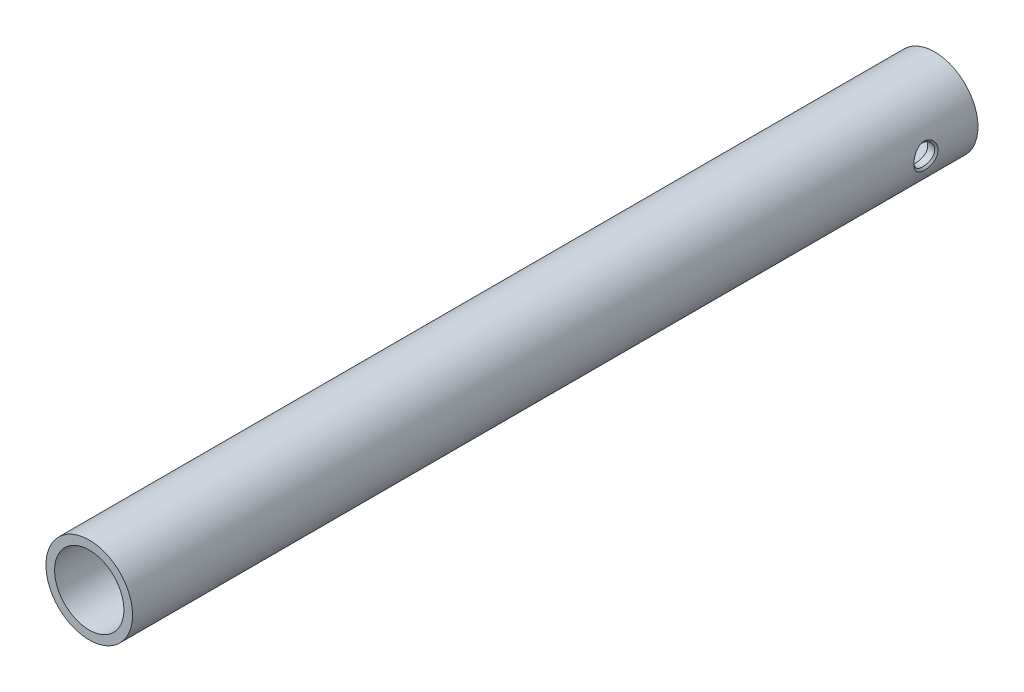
ISO-10303-21;
HEADER;
FILE_DESCRIPTION(('STEP AP214'),'2;1');
FILE_NAME('part.step','',(''),(''),'','','');
FILE_SCHEMA(('AUTOMOTIVE_DESIGN { 1 0 10303 214 1 1 1 1 }'));
ENDSEC;
DATA;
#1=APPLICATION_CONTEXT('core data for automotive mechanical design processes');
#2=APPLICATION_PROTOCOL_DEFINITION('international standard','automotive_design',2000,#1);
#3=PRODUCT_CONTEXT('',#1,'mechanical');
#4=PRODUCT('Part','Part','',(#3));
#5=PRODUCT_RELATED_PRODUCT_CATEGORY('part','',(#4));
#6=PRODUCT_DEFINITION_FORMATION('','',#4);
#7=PRODUCT_DEFINITION_CONTEXT('part definition',#1,'design');
#8=PRODUCT_DEFINITION('design','',#6,#7);
#9=PRODUCT_DEFINITION_SHAPE('','',#8);
#10=(LENGTH_UNIT() NAMED_UNIT(*) SI_UNIT(.MILLI.,.METRE.));
#11=(NAMED_UNIT(*) PLANE_ANGLE_UNIT() SI_UNIT($,.RADIAN.));
#12=(NAMED_UNIT(*) SI_UNIT($,.STERADIAN.) SOLID_ANGLE_UNIT());
#13=UNCERTAINTY_MEASURE_WITH_UNIT(LENGTH_MEASURE(1.E-05),#10,'distance_accuracy_value','');
#14=(GEOMETRIC_REPRESENTATION_CONTEXT(3) GLOBAL_UNCERTAINTY_ASSIGNED_CONTEXT((#13)) GLOBAL_UNIT_ASSIGNED_CONTEXT((#10,
#11,#12)) REPRESENTATION_CONTEXT('',''));
#15=CARTESIAN_POINT('',(0.,0.,0.));
#16=DIRECTION('',(0.,0.,1.));
#17=DIRECTION('',(1.,0.,0.));
#18=AXIS2_PLACEMENT_3D('',#15,#16,#17);
#19=CARTESIAN_POINT('',(20.,0.,15.));
#20=DIRECTION('',(-1.,0.,0.));
#21=DIRECTION('',(0.,0.,1.));
#22=AXIS2_PLACEMENT_3D('',#19,#20,#21);
#23=CYLINDRICAL_SURFACE('',#22,3.);
#24=CARTESIAN_POINT('',(-11.478240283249,3.,15.0000000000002));
#25=CARTESIAN_POINT('',(-11.478240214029,2.99999293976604,15.1375848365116));
#26=CARTESIAN_POINT('',(-11.4819038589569,2.99049685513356,15.2752455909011));
#27=CARTESIAN_POINT('',(-11.4920355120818,2.96223837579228,15.4794764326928));
#28=CARTESIAN_POINT('',(-11.4961904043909,2.95046871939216,15.5472278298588));
#29=CARTESIAN_POINT('',(-11.5059474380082,2.92233168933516,15.6816803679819));
#30=CARTESIAN_POINT('',(-11.5115496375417,2.90596413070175,15.7483814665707));
#31=CARTESIAN_POINT('',(-11.5251303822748,2.86569001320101,15.8911715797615));
#32=CARTESIAN_POINT('',(-11.533347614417,2.840988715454,15.9670144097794));
#33=CARTESIAN_POINT('',(-11.551564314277,2.78571140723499,16.116311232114));
#34=CARTESIAN_POINT('',(-11.5615639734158,2.75513476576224,16.1897649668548));
#35=CARTESIAN_POINT('',(-11.5829939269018,2.6883244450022,16.3338736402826));
#36=CARTESIAN_POINT('',(-11.5944247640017,2.65208861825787,16.4045275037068));
#37=CARTESIAN_POINT('',(-11.6183414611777,2.5742368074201,16.5425935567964));
#38=CARTESIAN_POINT('',(-11.6308273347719,2.5326207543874,16.610005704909));
#39=CARTESIAN_POINT('',(-11.67047635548,2.39626934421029,16.8124725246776));
#40=CARTESIAN_POINT('',(-11.6988728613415,2.29286943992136,16.9416056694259));
#41=CARTESIAN_POINT('',(-11.7560860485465,2.06643209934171,17.181074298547));
#42=CARTESIAN_POINT('',(-11.7849028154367,1.94339061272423,17.291405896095));
#43=CARTESIAN_POINT('',(-11.8408542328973,1.67542137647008,17.4944307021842));
#44=CARTESIAN_POINT('',(-11.8678857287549,1.52984739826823,17.5863103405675));
#45=CARTESIAN_POINT('',(-11.9039743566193,1.30091567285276,17.7046326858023));
#46=CARTESIAN_POINT('',(-11.9152652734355,1.2228020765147,17.7408370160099));
#47=CARTESIAN_POINT('',(-11.9360424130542,1.06355681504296,17.8064653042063));
#48=CARTESIAN_POINT('',(-11.9455294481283,0.982426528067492,17.8358923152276));
#49=CARTESIAN_POINT('',(-11.962188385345,0.81991033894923,17.8870078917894));
#50=CARTESIAN_POINT('',(-11.9694147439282,0.738587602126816,17.9088800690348));
#51=CARTESIAN_POINT('',(-11.9816766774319,0.574229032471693,17.9457345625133));
#52=CARTESIAN_POINT('',(-11.9867122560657,0.491193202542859,17.9607168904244));
#53=CARTESIAN_POINT('',(-11.9944399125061,0.324069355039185,17.9836373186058));
#54=CARTESIAN_POINT('',(-11.9971326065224,0.239981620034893,17.9915772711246));
#55=CARTESIAN_POINT('',(-12.0001183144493,0.0713955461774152,18.0003376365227));
#56=CARTESIAN_POINT('',(-12.0004114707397,-0.013102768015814,18.0011584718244));
#57=CARTESIAN_POINT('',(-11.9984724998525,-0.17787820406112,17.9958025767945));
#58=CARTESIAN_POINT('',(-11.9963580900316,-0.258167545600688,17.9899520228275));
#59=CARTESIAN_POINT('',(-11.9900387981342,-0.41793576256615,17.9718333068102));
#60=CARTESIAN_POINT('',(-11.9858338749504,-0.497414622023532,17.9595650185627));
#61=CARTESIAN_POINT('',(-11.9754934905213,-0.655025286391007,17.9287184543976));
#62=CARTESIAN_POINT('',(-11.9693576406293,-0.733156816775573,17.9101389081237));
#63=CARTESIAN_POINT('',(-11.9553000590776,-0.887496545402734,17.8668397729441));
#64=CARTESIAN_POINT('',(-11.9473791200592,-0.963705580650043,17.8421229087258));
#65=CARTESIAN_POINT('',(-11.9297014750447,-1.11415782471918,17.7865966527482));
#66=CARTESIAN_POINT('',(-11.9199343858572,-1.18838706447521,17.7557527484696));
#67=CARTESIAN_POINT('',(-11.8990164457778,-1.33397235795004,17.6882993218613));
#68=CARTESIAN_POINT('',(-11.8878655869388,-1.40532839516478,17.6516897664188));
#69=CARTESIAN_POINT('',(-11.8643590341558,-1.54474503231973,17.572969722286));
#70=CARTESIAN_POINT('',(-11.8520031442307,-1.61280509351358,17.5308583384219));
#71=CARTESIAN_POINT('',(-11.8264049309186,-1.74523362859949,17.4414224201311));
#72=CARTESIAN_POINT('',(-11.8131625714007,-1.80960195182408,17.3940976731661));
#73=CARTESIAN_POINT('',(-11.7855282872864,-1.93707501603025,17.2923108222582));
#74=CARTESIAN_POINT('',(-11.7711114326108,-1.99999550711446,17.2376245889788));
#75=CARTESIAN_POINT('',(-11.742558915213,-2.12110185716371,17.1231731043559));
#76=CARTESIAN_POINT('',(-11.7284232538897,-2.17928769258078,17.0634078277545));
#77=CARTESIAN_POINT('',(-11.7003298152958,-2.29052761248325,16.9391852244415));
#78=CARTESIAN_POINT('',(-11.6863721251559,-2.34357926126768,16.8747256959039));
#79=CARTESIAN_POINT('',(-11.6587654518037,-2.44415681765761,16.7415684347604));
#80=CARTESIAN_POINT('',(-11.6451164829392,-2.49168246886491,16.6728705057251));
#81=CARTESIAN_POINT('',(-11.6180585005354,-2.58208145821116,16.5297728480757));
#82=CARTESIAN_POINT('',(-11.604665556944,-2.6247971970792,16.4552699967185));
#83=CARTESIAN_POINT('',(-11.5855157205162,-2.68401126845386,16.340868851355));
#84=CARTESIAN_POINT('',(-11.5792883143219,-2.70294144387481,16.3022889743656));
#85=CARTESIAN_POINT('',(-11.5672505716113,-2.73915098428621,16.2242956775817));
#86=CARTESIAN_POINT('',(-11.5614402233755,-2.75643039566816,16.1848822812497));
#87=CARTESIAN_POINT('',(-11.5504295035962,-2.78928159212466,16.1053313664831));
#88=CARTESIAN_POINT('',(-11.5452283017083,-2.80485569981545,16.0651949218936));
#89=CARTESIAN_POINT('',(-11.5354369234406,-2.83428367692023,15.9842213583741));
#90=CARTESIAN_POINT('',(-11.5308467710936,-2.84813747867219,15.9433842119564));
#91=CARTESIAN_POINT('',(-11.522175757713,-2.87408255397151,15.8611095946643));
#92=CARTESIAN_POINT('',(-11.5180947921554,-2.88617418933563,15.8196722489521));
#93=CARTESIAN_POINT('',(-11.5104511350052,-2.90856729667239,15.7362747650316));
#94=CARTESIAN_POINT('',(-11.5068883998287,-2.91886891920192,15.6943146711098));
#95=CARTESIAN_POINT('',(-11.4994341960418,-2.94015234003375,15.5987441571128));
#96=CARTESIAN_POINT('',(-11.4957064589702,-2.9505889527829,15.5449974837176));
#97=CARTESIAN_POINT('',(-11.4909455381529,-2.96403011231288,15.4639774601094));
#98=CARTESIAN_POINT('',(-11.4894971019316,-2.96814127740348,15.4369064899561));
#99=CARTESIAN_POINT('',(-11.4867930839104,-2.97562226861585,15.3826512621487));
#100=CARTESIAN_POINT('',(-11.4855375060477,-2.97899207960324,15.3554670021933));
#101=CARTESIAN_POINT('',(-11.4833146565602,-2.98498630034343,15.3010098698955));
#102=CARTESIAN_POINT('',(-11.4823473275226,-2.98761085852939,15.2737370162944));
#103=CARTESIAN_POINT('',(-11.4807267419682,-2.99211238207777,15.2191219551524));
#104=CARTESIAN_POINT('',(-11.4800734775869,-2.99398936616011,15.1917797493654));
#105=CARTESIAN_POINT('',(-11.4785891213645,-2.99849564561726,15.1096729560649));
#106=CARTESIAN_POINT('',(-11.4782336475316,-2.99999978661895,15.0548325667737));
#107=CARTESIAN_POINT('',(-11.4782444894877,-3.00000013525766,14.9652428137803));
#108=CARTESIAN_POINT('',(-11.4783941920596,-2.99939598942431,14.9304887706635));
#109=CARTESIAN_POINT('',(-11.4791550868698,-2.99698072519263,14.8610255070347));
#110=CARTESIAN_POINT('',(-11.4797662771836,-2.99516961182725,14.8263162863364));
#111=CARTESIAN_POINT('',(-11.4814921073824,-2.99034359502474,14.7569924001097));
#112=CARTESIAN_POINT('',(-11.482606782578,-2.98732860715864,14.7223777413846));
#113=CARTESIAN_POINT('',(-11.4852442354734,-2.98010032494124,14.6532890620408));
#114=CARTESIAN_POINT('',(-11.4867670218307,-2.975887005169,14.6188150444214));
#115=CARTESIAN_POINT('',(-11.4901843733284,-2.96626554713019,14.5500273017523));
#116=CARTESIAN_POINT('',(-11.4920791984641,-2.96085657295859,14.5157137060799));
#117=CARTESIAN_POINT('',(-11.4962788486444,-2.94885620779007,14.4473220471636));
#118=CARTESIAN_POINT('',(-11.4985836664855,-2.94226483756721,14.4132439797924));
#119=CARTESIAN_POINT('',(-11.5060752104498,-2.9207310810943,14.3114210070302));
#120=CARTESIAN_POINT('',(-11.5118394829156,-2.90402777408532,14.2440782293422));
#121=CARTESIAN_POINT('',(-11.5220014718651,-2.87411120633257,14.1391432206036));
#122=CARTESIAN_POINT('',(-11.5259402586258,-2.86242729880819,14.1010594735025));
#123=CARTESIAN_POINT('',(-11.5344009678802,-2.83757309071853,14.0254423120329));
#124=CARTESIAN_POINT('',(-11.5389228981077,-2.82440277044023,13.9879089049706));
#125=CARTESIAN_POINT('',(-11.5484284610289,-2.79660021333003,13.9134426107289));
#126=CARTESIAN_POINT('',(-11.5534121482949,-2.78196780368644,13.8765097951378));
#127=CARTESIAN_POINT('',(-11.5637400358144,-2.75126916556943,13.8032986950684));
#128=CARTESIAN_POINT('',(-11.5690842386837,-2.73520292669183,13.7670204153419));
#129=CARTESIAN_POINT('',(-11.5855476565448,-2.68487774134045,13.6592086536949));
#130=CARTESIAN_POINT('',(-11.5970954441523,-2.64849867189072,13.5887152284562));
#131=CARTESIAN_POINT('',(-11.6209515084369,-2.57034690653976,13.4509383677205));
#132=CARTESIAN_POINT('',(-11.6332597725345,-2.52857429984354,13.3836548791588));
#133=CARTESIAN_POINT('',(-11.6590769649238,-2.43781817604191,13.2496020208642));
#134=CARTESIAN_POINT('',(-11.6726151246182,-2.38858879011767,13.1830038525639));
#135=CARTESIAN_POINT('',(-11.6934182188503,-2.31081436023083,13.086404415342));
#136=CARTESIAN_POINT('',(-11.7004361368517,-2.2842309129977,13.054750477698));
#137=CARTESIAN_POINT('',(-11.7146547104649,-2.22980098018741,12.9925901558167));
#138=CARTESIAN_POINT('',(-11.7218553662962,-2.20195449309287,12.9620837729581));
#139=CARTESIAN_POINT('',(-11.7435477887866,-2.11656780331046,12.8723348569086));
#140=CARTESIAN_POINT('',(-11.7581312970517,-2.05717566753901,12.8148567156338));
#141=CARTESIAN_POINT('',(-11.7869259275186,-1.93380917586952,12.7049602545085));
#142=CARTESIAN_POINT('',(-11.8011370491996,-1.8698348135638,12.6525419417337));
#143=CARTESIAN_POINT('',(-11.8291737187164,-1.73540433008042,12.5513910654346));
#144=CARTESIAN_POINT('',(-11.8429696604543,-1.66480167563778,12.5028447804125));
#145=CARTESIAN_POINT('',(-11.8692905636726,-1.51951470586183,12.4118696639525));
#146=CARTESIAN_POINT('',(-11.881815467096,-1.44483020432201,12.3694411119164));
#147=CARTESIAN_POINT('',(-11.8995029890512,-1.33016947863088,12.3106700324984));
#148=CARTESIAN_POINT('',(-11.9052158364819,-1.29150782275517,12.291890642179));
#149=CARTESIAN_POINT('',(-11.9163116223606,-1.21337146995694,12.2559923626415));
#150=CARTESIAN_POINT('',(-11.9216945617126,-1.17389677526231,12.238873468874));
#151=CARTESIAN_POINT('',(-11.9319688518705,-1.09419353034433,12.2063298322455));
#152=CARTESIAN_POINT('',(-11.936860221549,-1.05396500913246,12.1909050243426));
#153=CARTESIAN_POINT('',(-11.9461341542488,-0.972831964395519,12.1617864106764));
#154=CARTESIAN_POINT('',(-11.9505167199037,-0.931927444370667,12.1480925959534));
#155=CARTESIAN_POINT('',(-11.9626638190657,-0.810603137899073,12.1103707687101));
#156=CARTESIAN_POINT('',(-11.9697153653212,-0.729333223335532,12.0887906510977));
#157=CARTESIAN_POINT('',(-11.9817487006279,-0.565131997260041,12.0525098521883));
#158=CARTESIAN_POINT('',(-11.9867304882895,-0.482200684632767,12.0378091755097));
#159=CARTESIAN_POINT('',(-11.9944576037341,-0.315311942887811,12.0154292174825));
#160=CARTESIAN_POINT('',(-11.9972035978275,-0.231354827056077,12.0077478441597));
#161=CARTESIAN_POINT('',(-12.0001609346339,-0.0630517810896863,11.9994794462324));
#162=CARTESIAN_POINT('',(-12.0003724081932,0.0212941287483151,11.9988920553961));
#163=CARTESIAN_POINT('',(-11.9984089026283,0.186035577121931,12.0046900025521));
#164=CARTESIAN_POINT('',(-11.9963375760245,0.266443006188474,12.0107724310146));
#165=CARTESIAN_POINT('',(-11.9900510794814,0.426404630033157,12.0293649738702));
#166=CARTESIAN_POINT('',(-11.9858359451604,0.505958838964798,12.0418749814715));
#167=CARTESIAN_POINT('',(-11.9701117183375,0.74250780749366,12.088906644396));
#168=CARTESIAN_POINT('',(-11.9555219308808,0.897523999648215,12.1329348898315));
#169=CARTESIAN_POINT('',(-11.9196190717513,1.19814318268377,12.2449498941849));
#170=CARTESIAN_POINT('',(-11.8982885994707,1.34372062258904,12.312998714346));
#171=CARTESIAN_POINT('',(-11.8510599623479,1.62166149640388,12.4710153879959));
#172=CARTESIAN_POINT('',(-11.8251608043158,1.75402204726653,12.5609880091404));
#173=CARTESIAN_POINT('',(-11.7700297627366,2.00844090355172,12.7652627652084));
#174=CARTESIAN_POINT('',(-11.7406980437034,2.12971210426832,12.8805169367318));
#175=CARTESIAN_POINT('',(-11.682985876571,2.35164460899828,13.129816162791));
#176=CARTESIAN_POINT('',(-11.654605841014,2.45229706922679,13.263869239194));
#177=CARTESIAN_POINT('',(-11.6145908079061,2.58675574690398,13.4781351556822));
#178=CARTESIAN_POINT('',(-11.6015325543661,2.62924240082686,13.5527699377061));
#179=CARTESIAN_POINT('',(-11.5768403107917,2.70775914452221,13.7056220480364));
#180=CARTESIAN_POINT('',(-11.5652064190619,2.74378878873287,13.7838396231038));
#181=CARTESIAN_POINT('',(-11.54392685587,2.80902247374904,13.9432135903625));
#182=CARTESIAN_POINT('',(-11.5342786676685,2.83823516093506,14.0243661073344));
#183=CARTESIAN_POINT('',(-11.517105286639,2.88960513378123,14.1890602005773));
#184=CARTESIAN_POINT('',(-11.5095794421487,2.91176458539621,14.2726010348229));
#185=CARTESIAN_POINT('',(-11.4952050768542,2.95339645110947,14.4623541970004));
#186=CARTESIAN_POINT('',(-11.4889838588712,2.97085057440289,14.5690660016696));
#187=CARTESIAN_POINT('',(-11.4805022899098,2.99415277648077,14.7838366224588));
#188=CARTESIAN_POINT('',(-11.4782403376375,3.00000554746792,14.8918948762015));
#189=CARTESIAN_POINT('',(-11.478240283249,3.,15.0000000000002));
#190=B_SPLINE_CURVE_WITH_KNOTS('',3,(#24,#25,#26,#27,#28,#29,#30,#31,#32,#33,#34,#35,#36,#37,
#38,#39,#40,#41,#42,#43,#44,#45,#46,#47,#48,#49,#50,#51,#52,#53,#54,#55,#56,#57,#58,#59,#60,#61,
#62,#63,#64,#65,#66,#67,#68,#69,#70,#71,#72,#73,#74,#75,#76,#77,#78,#79,#80,#81,#82,#83,#84,#85,
#86,#87,#88,#89,#90,#91,#92,#93,#94,#95,#96,#97,#98,#99,#100,#101,#102,#103,#104,#105,#106,#107,
#108,#109,#110,#111,#112,#113,#114,#115,#116,#117,#118,#119,#120,#121,#122,#123,#124,#125,#126,
#127,#128,#129,#130,#131,#132,#133,#134,#135,#136,#137,#138,#139,#140,#141,#142,#143,#144,#145,
#146,#147,#148,#149,#150,#151,#152,#153,#154,#155,#156,#157,#158,#159,#160,#161,#162,#163,#164,
#165,#166,#167,#168,#169,#170,#171,#172,#173,#174,#175,#176,#177,#178,#179,#180,#181,#182,#183,
#184,#185,#186,#187,#188,#189),.UNSPECIFIED.,.T.,.F.,(4,2,2,2,2,2,2,2,2,2,2,2,2,2,2,2,2,2,2,2,2,
2,2,2,2,2,2,2,2,2,2,2,2,2,2,2,2,2,2,2,2,2,2,2,2,2,2,2,2,2,2,2,2,2,2,2,2,2,2,2,2,2,2,2,2,2,2,2,2,
2,2,2,2,2,2,2,2,2,2,2,2,2,4),(0.,0.412435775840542,0.618971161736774,0.825514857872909,
1.06579580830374,1.30610257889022,1.54650075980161,1.78690202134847,2.28799918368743,
2.78919981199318,3.30913696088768,3.56936291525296,3.82947141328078,4.08272035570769,
4.33596886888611,4.58915075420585,4.84231761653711,5.08361841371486,5.32492395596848,
5.56627809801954,5.8075252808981,6.05017200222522,6.29282011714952,6.53550776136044,
6.77820530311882,7.03172213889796,7.28524023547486,7.53887801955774,7.7925275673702,
8.05293198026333,8.18316693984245,8.3133982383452,8.44344989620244,8.57350666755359,
8.70353669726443,8.83355578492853,8.99808430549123,9.080334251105,9.1625858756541,
9.2448211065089,9.32705427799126,9.49153381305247,9.59579385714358,9.7000534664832,
9.80432038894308,9.90858952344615,10.0129317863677,10.1172722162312,10.3259255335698,
10.4459872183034,10.5660504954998,10.6861279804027,10.8062063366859,11.0464176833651,
11.28662505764,11.538066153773,11.6638182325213,11.7895704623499,12.0410521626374,
12.2925342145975,12.5525793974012,12.8126364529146,12.9426807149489,13.0727246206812,
13.2027635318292,13.3328017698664,13.5855988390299,13.8383960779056,14.0911179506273,
14.3438267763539,14.5855169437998,14.827203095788,15.3101749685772,15.7944039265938,
16.2787382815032,16.7860596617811,17.2935981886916,17.5539322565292,17.8142842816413,
18.0743042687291,18.3342443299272,18.658440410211,18.9825053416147),.UNSPECIFIED.);
#191=CARTESIAN_POINT('',(-11.478240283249,-3.,15.));
#192=VERTEX_POINT('',#191);
#193=EDGE_CURVE('E85',#192,#192,#190,.T.);
#194=ORIENTED_EDGE('',*,*,#193,.F.);
#195=EDGE_LOOP('',(#194));
#196=FACE_BOUND('',#195,.T.);
#197=CARTESIAN_POINT('',(-10.,0.,18.));
#198=CARTESIAN_POINT('',(-9.99999523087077,-0.164487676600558,17.9999929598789));
#199=CARTESIAN_POINT('',(-9.99589998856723,-0.329062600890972,17.9864193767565));
#200=CARTESIAN_POINT('',(-9.9799502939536,-0.653487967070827,17.9325834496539));
#201=CARTESIAN_POINT('',(-9.96808875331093,-0.81333395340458,17.8922967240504));
#202=CARTESIAN_POINT('',(-9.93790971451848,-1.12347399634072,17.7865037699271));
#203=CARTESIAN_POINT('',(-9.91960326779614,-1.27378388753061,17.7210406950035));
#204=CARTESIAN_POINT('',(-9.87843892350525,-1.56126909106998,17.5669149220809));
#205=CARTESIAN_POINT('',(-9.85558108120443,-1.69844456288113,17.478252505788));
#206=CARTESIAN_POINT('',(-9.80701717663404,-1.95973013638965,17.2775624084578));
#207=CARTESIAN_POINT('',(-9.78125279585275,-2.08341124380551,17.1649903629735));
#208=CARTESIAN_POINT('',(-9.73012178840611,-2.31047790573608,16.9208067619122));
#209=CARTESIAN_POINT('',(-9.70475531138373,-2.41385598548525,16.7891882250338));
#210=CARTESIAN_POINT('',(-9.6566703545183,-2.59964598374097,16.5069933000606));
#211=CARTESIAN_POINT('',(-9.63402572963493,-2.68152414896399,16.3560520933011));
#212=CARTESIAN_POINT('',(-9.59485656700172,-2.81848362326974,16.0418458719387));
#213=CARTESIAN_POINT('',(-9.57832464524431,-2.87359728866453,15.8785960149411));
#214=CARTESIAN_POINT('',(-9.55725412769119,-2.94274365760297,15.5954746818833));
#215=CARTESIAN_POINT('',(-9.55059694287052,-2.96417327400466,15.477515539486));
#216=CARTESIAN_POINT('',(-9.54166396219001,-2.99280360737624,15.2397197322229));
#217=CARTESIAN_POINT('',(-9.53938788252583,-3.00000524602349,15.1198831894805));
#218=CARTESIAN_POINT('',(-9.53939767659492,-2.99999281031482,14.8356998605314));
#219=CARTESIAN_POINT('',(-9.54368620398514,-2.986449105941,14.671312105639));
#220=CARTESIAN_POINT('',(-9.56032302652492,-2.93274266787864,14.3472762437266));
#221=CARTESIAN_POINT('',(-9.57267890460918,-2.89255488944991,14.1876327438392));
#222=CARTESIAN_POINT('',(-9.60392344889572,-2.78705093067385,13.8779221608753));
#223=CARTESIAN_POINT('',(-9.622799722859,-2.72178239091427,13.7278375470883));
#224=CARTESIAN_POINT('',(-9.66494191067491,-2.56811578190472,13.4407357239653));
#225=CARTESIAN_POINT('',(-9.68820785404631,-2.47971755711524,13.3037186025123));
#226=CARTESIAN_POINT('',(-9.73733478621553,-2.27930547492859,13.0422806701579));
#227=CARTESIAN_POINT('',(-9.76325101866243,-2.16668769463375,12.9183330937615));
#228=CARTESIAN_POINT('',(-9.81429220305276,-1.92229767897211,12.6907446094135));
#229=CARTESIAN_POINT('',(-9.83941689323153,-1.79051918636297,12.5871103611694));
#230=CARTESIAN_POINT('',(-9.88667585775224,-1.50815826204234,12.4010297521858));
#231=CARTESIAN_POINT('',(-9.90873597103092,-1.35723813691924,12.3190758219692));
#232=CARTESIAN_POINT('',(-9.94670396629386,-1.04307541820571,12.1819701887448));
#233=CARTESIAN_POINT('',(-9.96261906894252,-0.879847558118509,12.1267870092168));
#234=CARTESIAN_POINT('',(-9.9828758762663,-0.596547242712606,12.0574638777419));
#235=CARTESIAN_POINT('',(-9.98926272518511,-0.478371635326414,12.0359558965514));
#236=CARTESIAN_POINT('',(-9.99782641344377,-0.240146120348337,12.0072217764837));
#237=CARTESIAN_POINT('',(-10.0000034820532,-0.120096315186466,11.9999948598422));
#238=CARTESIAN_POINT('',(-9.99999523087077,0.164487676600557,12.0000070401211));
#239=CARTESIAN_POINT('',(-9.99589998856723,0.329062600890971,12.0135806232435));
#240=CARTESIAN_POINT('',(-9.9799502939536,0.653487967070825,12.0674165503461));
#241=CARTESIAN_POINT('',(-9.96808875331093,0.813333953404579,12.1077032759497));
#242=CARTESIAN_POINT('',(-9.93790971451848,1.12347399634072,12.2134962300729));
#243=CARTESIAN_POINT('',(-9.91960326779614,1.2737838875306,12.2789593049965));
#244=CARTESIAN_POINT('',(-9.87843892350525,1.56126909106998,12.4330850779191));
#245=CARTESIAN_POINT('',(-9.85558108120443,1.69844456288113,12.521747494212));
#246=CARTESIAN_POINT('',(-9.80701717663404,1.95973013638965,12.7224375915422));
#247=CARTESIAN_POINT('',(-9.78125279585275,2.08341124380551,12.8350096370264));
#248=CARTESIAN_POINT('',(-9.73012178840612,2.31047790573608,13.0791932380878));
#249=CARTESIAN_POINT('',(-9.70475531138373,2.41385598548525,13.2108117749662));
#250=CARTESIAN_POINT('',(-9.6566703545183,2.59964598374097,13.4930066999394));
#251=CARTESIAN_POINT('',(-9.63402572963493,2.68152414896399,13.6439479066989));
#252=CARTESIAN_POINT('',(-9.59485656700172,2.81848362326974,13.9581541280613));
#253=CARTESIAN_POINT('',(-9.57832464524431,2.87359728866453,14.1214039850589));
#254=CARTESIAN_POINT('',(-9.55725412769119,2.94274365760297,14.4045253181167));
#255=CARTESIAN_POINT('',(-9.55059694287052,2.96417327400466,14.522484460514));
#256=CARTESIAN_POINT('',(-9.54166396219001,2.99280360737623,14.7602802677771));
#257=CARTESIAN_POINT('',(-9.53938788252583,3.00000524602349,14.8801168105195));
#258=CARTESIAN_POINT('',(-9.53939767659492,2.99999281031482,15.1643001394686));
#259=CARTESIAN_POINT('',(-9.54368620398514,2.986449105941,15.328687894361));
#260=CARTESIAN_POINT('',(-9.56032302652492,2.93274266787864,15.6527237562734));
#261=CARTESIAN_POINT('',(-9.57267890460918,2.89255488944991,15.8123672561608));
#262=CARTESIAN_POINT('',(-9.60392344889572,2.78705093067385,16.1220778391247));
#263=CARTESIAN_POINT('',(-9.622799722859,2.72178239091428,16.2721624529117));
#264=CARTESIAN_POINT('',(-9.66494191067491,2.56811578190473,16.5592642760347));
#265=CARTESIAN_POINT('',(-9.68820785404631,2.47971755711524,16.6962813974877));
#266=CARTESIAN_POINT('',(-9.73733478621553,2.27930547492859,16.9577193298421));
#267=CARTESIAN_POINT('',(-9.76325101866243,2.16668769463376,17.0816669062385));
#268=CARTESIAN_POINT('',(-9.81429220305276,1.92229767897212,17.3092553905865));
#269=CARTESIAN_POINT('',(-9.83941689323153,1.79051918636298,17.4128896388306));
#270=CARTESIAN_POINT('',(-9.88667585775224,1.50815826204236,17.5989702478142));
#271=CARTESIAN_POINT('',(-9.90873597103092,1.35723813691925,17.6809241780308));
#272=CARTESIAN_POINT('',(-9.94670396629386,1.04307541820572,17.8180298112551));
#273=CARTESIAN_POINT('',(-9.96261906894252,0.879847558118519,17.8732129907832));
#274=CARTESIAN_POINT('',(-9.9828758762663,0.596547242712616,17.9425361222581));
#275=CARTESIAN_POINT('',(-9.98926272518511,0.478371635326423,17.9640441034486));
#276=CARTESIAN_POINT('',(-9.99782641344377,0.240146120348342,17.9927782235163));
#277=CARTESIAN_POINT('',(-10.0000034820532,0.120096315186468,18.0000051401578));
#278=CARTESIAN_POINT('',(-10.,0.,18.));
#279=B_SPLINE_CURVE_WITH_KNOTS('',3,(#197,#198,#199,#200,#201,#202,#203,#204,#205,#206,#207,
#208,#209,#210,#211,#212,#213,#214,#215,#216,#217,#218,#219,#220,#221,#222,#223,#224,#225,#226,
#227,#228,#229,#230,#231,#232,#233,#234,#235,#236,#237,#238,#239,#240,#241,#242,#243,#244,#245,
#246,#247,#248,#249,#250,#251,#252,#253,#254,#255,#256,#257,#258,#259,#260,#261,#262,#263,#264,
#265,#266,#267,#268,#269,#270,#271,#272,#273,#274,#275,#276,#277,#278),.UNSPECIFIED.,.T.,.F.,(4,
2,2,2,2,2,2,2,2,2,2,2,2,2,2,2,2,2,2,2,2,2,2,2,2,2,2,2,2,2,2,2,2,2,2,2,2,2,2,2,4),(0.,
0.493014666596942,0.98647993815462,1.47910312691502,1.9717203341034,2.47706169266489,
2.98258875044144,3.49968088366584,4.01614632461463,4.37549115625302,4.73481270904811,
5.22726358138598,5.72017800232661,6.2121607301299,6.70414676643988,7.21022539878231,
7.71646967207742,8.2333803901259,8.74968185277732,9.10966304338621,9.46962462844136,
9.96263929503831,10.456104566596,10.9487277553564,11.4413449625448,11.9466863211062,
12.4522133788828,12.9693055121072,13.485770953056,13.8451157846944,14.2044373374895,
14.6968882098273,15.189802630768,15.6817853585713,16.1737713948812,16.6798500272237,
17.1860943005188,17.7030050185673,18.2193064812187,18.5792876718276,18.9392492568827),.UNSPECIFIED.);
#280=CARTESIAN_POINT('',(-10.,0.,18.));
#281=VERTEX_POINT('',#280);
#282=EDGE_CURVE('E81',#281,#281,#279,.T.);
#283=ORIENTED_EDGE('',*,*,#282,.T.);
#284=EDGE_LOOP('',(#283));
#285=FACE_BOUND('',#284,.T.);
#286=ADVANCED_FACE('F14',(#196,#285),#23,.F.);
#287=CARTESIAN_POINT('',(20.,0.,15.));
#288=DIRECTION('',(-1.,0.,0.));
#289=DIRECTION('',(0.,0.,1.));
#290=AXIS2_PLACEMENT_3D('',#287,#288,#289);
#291=CYLINDRICAL_SURFACE('',#290,3.);
#292=CARTESIAN_POINT('',(11.478240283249,3.,15.0000000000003));
#293=CARTESIAN_POINT('',(11.478240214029,2.99999293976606,14.8624151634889));
#294=CARTESIAN_POINT('',(11.4819038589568,2.99049685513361,14.7247544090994));
#295=CARTESIAN_POINT('',(11.4920355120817,2.96223837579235,14.5205235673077));
#296=CARTESIAN_POINT('',(11.4961904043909,2.95046871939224,14.4527721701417));
#297=CARTESIAN_POINT('',(11.5059474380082,2.92233168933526,14.3183196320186));
#298=CARTESIAN_POINT('',(11.5115496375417,2.90596413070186,14.2516185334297));
#299=CARTESIAN_POINT('',(11.5251303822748,2.86569001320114,14.1088284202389));
#300=CARTESIAN_POINT('',(11.533347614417,2.84098871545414,14.032985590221));
#301=CARTESIAN_POINT('',(11.551564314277,2.78571140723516,13.8836887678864));
#302=CARTESIAN_POINT('',(11.5615639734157,2.75513476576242,13.8102350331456));
#303=CARTESIAN_POINT('',(11.5829939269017,2.6883244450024,13.6661263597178));
#304=CARTESIAN_POINT('',(11.5944247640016,2.65208861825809,13.5954724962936));
#305=CARTESIAN_POINT('',(11.6183414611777,2.57423680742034,13.457406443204));
#306=CARTESIAN_POINT('',(11.6308273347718,2.53262075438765,13.3899942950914));
#307=CARTESIAN_POINT('',(11.67047635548,2.39626934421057,13.1875274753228));
#308=CARTESIAN_POINT('',(11.6988728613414,2.29286943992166,13.0583943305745));
#309=CARTESIAN_POINT('',(11.7560860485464,2.06643209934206,12.8189257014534));
#310=CARTESIAN_POINT('',(11.7849028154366,1.9433906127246,12.7085941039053));
#311=CARTESIAN_POINT('',(11.8408542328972,1.67542137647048,12.505569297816));
#312=CARTESIAN_POINT('',(11.8678857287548,1.52984739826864,12.4136896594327));
#313=CARTESIAN_POINT('',(11.9039743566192,1.3009156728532,12.2953673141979));
#314=CARTESIAN_POINT('',(11.9152652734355,1.22280207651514,12.2591629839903));
#315=CARTESIAN_POINT('',(11.9360424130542,1.06355681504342,12.1935346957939));
#316=CARTESIAN_POINT('',(11.9455294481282,0.982426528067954,12.1641076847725));
#317=CARTESIAN_POINT('',(11.962188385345,0.819910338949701,12.1129921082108));
#318=CARTESIAN_POINT('',(11.9694147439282,0.738587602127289,12.0911199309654));
#319=CARTESIAN_POINT('',(11.9816766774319,0.574229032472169,12.0542654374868));
#320=CARTESIAN_POINT('',(11.9867122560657,0.491193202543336,12.0392831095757));
#321=CARTESIAN_POINT('',(11.9944399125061,0.324069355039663,12.0163626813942));
#322=CARTESIAN_POINT('',(11.9971326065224,0.239981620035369,12.0084227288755));
#323=CARTESIAN_POINT('',(12.0001183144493,0.071395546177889,11.9996623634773));
#324=CARTESIAN_POINT('',(12.0004114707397,-0.0131027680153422,11.9988415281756));
#325=CARTESIAN_POINT('',(11.9984724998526,-0.177878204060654,12.0041974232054));
#326=CARTESIAN_POINT('',(11.9963580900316,-0.258167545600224,12.0100479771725));
#327=CARTESIAN_POINT('',(11.9900387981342,-0.417935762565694,12.0281666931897));
#328=CARTESIAN_POINT('',(11.9858338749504,-0.49741462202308,12.0404349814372));
#329=CARTESIAN_POINT('',(11.9754934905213,-0.655025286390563,12.0712815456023));
#330=CARTESIAN_POINT('',(11.9693576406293,-0.733156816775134,12.0898610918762));
#331=CARTESIAN_POINT('',(11.9553000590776,-0.887496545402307,12.1331602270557));
#332=CARTESIAN_POINT('',(11.9473791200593,-0.963705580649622,12.1578770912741));
#333=CARTESIAN_POINT('',(11.9297014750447,-1.11415782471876,12.2134033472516));
#334=CARTESIAN_POINT('',(11.9199343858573,-1.1883870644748,12.2442472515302));
#335=CARTESIAN_POINT('',(11.8990164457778,-1.33397235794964,12.3117006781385));
#336=CARTESIAN_POINT('',(11.8878655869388,-1.40532839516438,12.348310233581));
#337=CARTESIAN_POINT('',(11.8643590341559,-1.54474503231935,12.4270302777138));
#338=CARTESIAN_POINT('',(11.8520031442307,-1.61280509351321,12.4691416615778));
#339=CARTESIAN_POINT('',(11.8264049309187,-1.74523362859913,12.5585775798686));
#340=CARTESIAN_POINT('',(11.8131625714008,-1.80960195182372,12.6059023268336));
#341=CARTESIAN_POINT('',(11.7855282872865,-1.9370750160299,12.7076891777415));
#342=CARTESIAN_POINT('',(11.7711114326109,-1.99999550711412,12.7623754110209));
#343=CARTESIAN_POINT('',(11.7425589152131,-2.12110185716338,12.8768268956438));
#344=CARTESIAN_POINT('',(11.7284232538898,-2.17928769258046,12.9365921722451));
#345=CARTESIAN_POINT('',(11.7003298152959,-2.29052761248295,13.0608147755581));
#346=CARTESIAN_POINT('',(11.686372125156,-2.34357926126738,13.1252743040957));
#347=CARTESIAN_POINT('',(11.6587654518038,-2.44415681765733,13.2584315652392));
#348=CARTESIAN_POINT('',(11.6451164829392,-2.49168246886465,13.3271294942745));
#349=CARTESIAN_POINT('',(11.6180585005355,-2.58208145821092,13.4702271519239));
#350=CARTESIAN_POINT('',(11.604665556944,-2.62479719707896,13.5447300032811));
#351=CARTESIAN_POINT('',(11.5855157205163,-2.68401126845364,13.6591311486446));
#352=CARTESIAN_POINT('',(11.579288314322,-2.7029414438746,13.6977110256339));
#353=CARTESIAN_POINT('',(11.5672505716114,-2.73915098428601,13.7757043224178));
#354=CARTESIAN_POINT('',(11.5614402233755,-2.75643039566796,13.8151177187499));
#355=CARTESIAN_POINT('',(11.5504295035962,-2.78928159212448,13.8946686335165));
#356=CARTESIAN_POINT('',(11.5452283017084,-2.80485569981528,13.9348050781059));
#357=CARTESIAN_POINT('',(11.5354369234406,-2.83428367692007,14.0157786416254));
#358=CARTESIAN_POINT('',(11.5308467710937,-2.84813747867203,14.0566157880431));
#359=CARTESIAN_POINT('',(11.522175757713,-2.87408255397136,14.1388904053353));
#360=CARTESIAN_POINT('',(11.5180947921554,-2.8861741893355,14.1803277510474));
#361=CARTESIAN_POINT('',(11.5104511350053,-2.90856729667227,14.2637252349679));
#362=CARTESIAN_POINT('',(11.5068883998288,-2.9188689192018,14.3056853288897));
#363=CARTESIAN_POINT('',(11.4994341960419,-2.94015234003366,14.4012558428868));
#364=CARTESIAN_POINT('',(11.4957064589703,-2.95058895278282,14.455002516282));
#365=CARTESIAN_POINT('',(11.4909455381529,-2.96403011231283,14.5360225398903));
#366=CARTESIAN_POINT('',(11.4894971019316,-2.96814127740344,14.5630935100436));
#367=CARTESIAN_POINT('',(11.4867930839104,-2.97562226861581,14.617348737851));
#368=CARTESIAN_POINT('',(11.4855375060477,-2.97899207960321,14.6445329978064));
#369=CARTESIAN_POINT('',(11.4833146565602,-2.98498630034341,14.6989901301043));
#370=CARTESIAN_POINT('',(11.4823473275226,-2.98761085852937,14.7262629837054));
#371=CARTESIAN_POINT('',(11.4807267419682,-2.99211238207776,14.7808780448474));
#372=CARTESIAN_POINT('',(11.4800734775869,-2.9939893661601,14.8082202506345));
#373=CARTESIAN_POINT('',(11.4785891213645,-2.99849564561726,14.8903270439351));
#374=CARTESIAN_POINT('',(11.4782336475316,-2.99999978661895,14.9451674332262));
#375=CARTESIAN_POINT('',(11.4782444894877,-3.00000013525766,15.0347571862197));
#376=CARTESIAN_POINT('',(11.4783941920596,-2.99939598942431,15.0695112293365));
#377=CARTESIAN_POINT('',(11.4791550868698,-2.99698072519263,15.1389744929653));
#378=CARTESIAN_POINT('',(11.4797662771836,-2.99516961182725,15.1736837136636));
#379=CARTESIAN_POINT('',(11.4814921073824,-2.99034359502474,15.2430075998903));
#380=CARTESIAN_POINT('',(11.482606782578,-2.98732860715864,15.2776222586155));
#381=CARTESIAN_POINT('',(11.4852442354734,-2.98010032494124,15.3467109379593));
#382=CARTESIAN_POINT('',(11.4867670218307,-2.975887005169,15.3811849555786));
#383=CARTESIAN_POINT('',(11.4901843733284,-2.96626554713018,15.4499726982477));
#384=CARTESIAN_POINT('',(11.4920791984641,-2.96085657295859,15.4842862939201));
#385=CARTESIAN_POINT('',(11.4962788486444,-2.94885620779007,15.5526779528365));
#386=CARTESIAN_POINT('',(11.4985836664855,-2.94226483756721,15.5867560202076));
#387=CARTESIAN_POINT('',(11.5060752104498,-2.92073108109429,15.6885789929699));
#388=CARTESIAN_POINT('',(11.5118394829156,-2.90402777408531,15.7559217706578));
#389=CARTESIAN_POINT('',(11.5220014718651,-2.87411120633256,15.8608567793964));
#390=CARTESIAN_POINT('',(11.5259402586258,-2.86242729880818,15.8989405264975));
#391=CARTESIAN_POINT('',(11.5344009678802,-2.83757309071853,15.9745576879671));
#392=CARTESIAN_POINT('',(11.5389228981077,-2.82440277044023,16.0120910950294));
#393=CARTESIAN_POINT('',(11.5484284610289,-2.79660021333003,16.0865573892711));
#394=CARTESIAN_POINT('',(11.553412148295,-2.78196780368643,16.1234902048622));
#395=CARTESIAN_POINT('',(11.5637400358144,-2.75126916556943,16.1967013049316));
#396=CARTESIAN_POINT('',(11.5690842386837,-2.73520292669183,16.2329795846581));
#397=CARTESIAN_POINT('',(11.5855476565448,-2.68487774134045,16.3407913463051));
#398=CARTESIAN_POINT('',(11.5970954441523,-2.64849867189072,16.4112847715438));
#399=CARTESIAN_POINT('',(11.6209515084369,-2.57034690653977,16.5490616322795));
#400=CARTESIAN_POINT('',(11.6332597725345,-2.52857429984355,16.6163451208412));
#401=CARTESIAN_POINT('',(11.6590769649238,-2.43781817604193,16.7503979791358));
#402=CARTESIAN_POINT('',(11.6726151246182,-2.38858879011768,16.816996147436));
#403=CARTESIAN_POINT('',(11.6934182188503,-2.31081436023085,16.913595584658));
#404=CARTESIAN_POINT('',(11.7004361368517,-2.28423091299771,16.945249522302));
#405=CARTESIAN_POINT('',(11.7146547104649,-2.22980098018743,17.0074098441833));
#406=CARTESIAN_POINT('',(11.7218553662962,-2.20195449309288,17.0379162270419));
#407=CARTESIAN_POINT('',(11.7435477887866,-2.11656780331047,17.1276651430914));
#408=CARTESIAN_POINT('',(11.7581312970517,-2.05717566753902,17.1851432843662));
#409=CARTESIAN_POINT('',(11.7869259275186,-1.93380917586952,17.2950397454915));
#410=CARTESIAN_POINT('',(11.8011370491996,-1.86983481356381,17.3474580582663));
#411=CARTESIAN_POINT('',(11.8291737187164,-1.73540433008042,17.4486089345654));
#412=CARTESIAN_POINT('',(11.8429696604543,-1.66480167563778,17.4971552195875));
#413=CARTESIAN_POINT('',(11.8692905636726,-1.51951470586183,17.5881303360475));
#414=CARTESIAN_POINT('',(11.881815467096,-1.44483020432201,17.6305588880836));
#415=CARTESIAN_POINT('',(11.8995029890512,-1.33016947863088,17.6893299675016));
#416=CARTESIAN_POINT('',(11.9052158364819,-1.29150782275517,17.708109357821));
#417=CARTESIAN_POINT('',(11.9163116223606,-1.21337146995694,17.7440076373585));
#418=CARTESIAN_POINT('',(11.9216945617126,-1.17389677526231,17.761126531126));
#419=CARTESIAN_POINT('',(11.9319688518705,-1.09419353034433,17.7936701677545));
#420=CARTESIAN_POINT('',(11.936860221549,-1.05396500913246,17.8090949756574));
#421=CARTESIAN_POINT('',(11.9461341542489,-0.97283196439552,17.8382135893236));
#422=CARTESIAN_POINT('',(11.9505167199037,-0.931927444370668,17.8519074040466));
#423=CARTESIAN_POINT('',(11.9626638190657,-0.810603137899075,17.8896292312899));
#424=CARTESIAN_POINT('',(11.9697153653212,-0.729333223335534,17.9112093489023));
#425=CARTESIAN_POINT('',(11.9817487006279,-0.565131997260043,17.9474901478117));
#426=CARTESIAN_POINT('',(11.9867304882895,-0.48220068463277,17.9621908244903));
#427=CARTESIAN_POINT('',(11.9944576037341,-0.315311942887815,17.9845707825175));
#428=CARTESIAN_POINT('',(11.9972035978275,-0.231354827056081,17.9922521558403));
#429=CARTESIAN_POINT('',(12.0001609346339,-0.063051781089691,18.0005205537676));
#430=CARTESIAN_POINT('',(12.0003724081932,0.0212941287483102,18.0011079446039));
#431=CARTESIAN_POINT('',(11.9984089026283,0.186035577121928,17.9953099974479));
#432=CARTESIAN_POINT('',(11.9963375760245,0.266443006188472,17.9892275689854));
#433=CARTESIAN_POINT('',(11.9900510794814,0.426404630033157,17.9706350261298));
#434=CARTESIAN_POINT('',(11.9858359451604,0.505958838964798,17.9581250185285));
#435=CARTESIAN_POINT('',(11.9701117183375,0.742507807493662,17.911093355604));
#436=CARTESIAN_POINT('',(11.9555219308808,0.897523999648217,17.8670651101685));
#437=CARTESIAN_POINT('',(11.9196190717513,1.19814318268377,17.7550501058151));
#438=CARTESIAN_POINT('',(11.8982885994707,1.34372062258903,17.687001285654));
#439=CARTESIAN_POINT('',(11.8510599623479,1.62166149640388,17.5289846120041));
#440=CARTESIAN_POINT('',(11.8251608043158,1.75402204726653,17.4390119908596));
#441=CARTESIAN_POINT('',(11.7700297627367,2.00844090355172,17.2347372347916));
#442=CARTESIAN_POINT('',(11.7406980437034,2.12971210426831,17.1194830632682));
#443=CARTESIAN_POINT('',(11.682985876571,2.35164460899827,16.870183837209));
#444=CARTESIAN_POINT('',(11.654605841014,2.45229706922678,16.736130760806));
#445=CARTESIAN_POINT('',(11.6145908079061,2.58675574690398,16.5218648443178));
#446=CARTESIAN_POINT('',(11.6015325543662,2.62924240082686,16.4472300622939));
#447=CARTESIAN_POINT('',(11.5768403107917,2.70775914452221,16.2943779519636));
#448=CARTESIAN_POINT('',(11.5652064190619,2.74378878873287,16.2161603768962));
#449=CARTESIAN_POINT('',(11.54392685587,2.80902247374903,16.0567864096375));
#450=CARTESIAN_POINT('',(11.5342786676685,2.83823516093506,15.9756338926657));
#451=CARTESIAN_POINT('',(11.517105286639,2.88960513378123,15.8109397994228));
#452=CARTESIAN_POINT('',(11.5095794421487,2.91176458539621,15.7273989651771));
#453=CARTESIAN_POINT('',(11.4952050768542,2.95339645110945,15.5376458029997));
#454=CARTESIAN_POINT('',(11.4889838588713,2.97085057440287,15.4309339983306));
#455=CARTESIAN_POINT('',(11.4805022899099,2.99415277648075,15.2161633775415));
#456=CARTESIAN_POINT('',(11.4782403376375,3.0000055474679,15.1081051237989));
#457=CARTESIAN_POINT('',(11.478240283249,3.,15.0000000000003));
#458=B_SPLINE_CURVE_WITH_KNOTS('',3,(#292,#293,#294,#295,#296,#297,#298,#299,#300,#301,#302,
#303,#304,#305,#306,#307,#308,#309,#310,#311,#312,#313,#314,#315,#316,#317,#318,#319,#320,#321,
#322,#323,#324,#325,#326,#327,#328,#329,#330,#331,#332,#333,#334,#335,#336,#337,#338,#339,#340,
#341,#342,#343,#344,#345,#346,#347,#348,#349,#350,#351,#352,#353,#354,#355,#356,#357,#358,#359,
#360,#361,#362,#363,#364,#365,#366,#367,#368,#369,#370,#371,#372,#373,#374,#375,#376,#377,#378,
#379,#380,#381,#382,#383,#384,#385,#386,#387,#388,#389,#390,#391,#392,#393,#394,#395,#396,#397,
#398,#399,#400,#401,#402,#403,#404,#405,#406,#407,#408,#409,#410,#411,#412,#413,#414,#415,#416,
#417,#418,#419,#420,#421,#422,#423,#424,#425,#426,#427,#428,#429,#430,#431,#432,#433,#434,#435,
#436,#437,#438,#439,#440,#441,#442,#443,#444,#445,#446,#447,#448,#449,#450,#451,#452,#453,#454,
#455,#456,#457),.UNSPECIFIED.,.T.,.F.,(4,2,2,2,2,2,2,2,2,2,2,2,2,2,2,2,2,2,2,2,2,2,2,2,2,2,2,2,
2,2,2,2,2,2,2,2,2,2,2,2,2,2,2,2,2,2,2,2,2,2,2,2,2,2,2,2,2,2,2,2,2,2,2,2,2,2,2,2,2,2,2,2,2,2,2,2,
2,2,2,2,2,2,4),(0.,0.412435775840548,0.618971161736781,0.825514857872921,1.06579580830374,
1.30610257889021,1.54650075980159,1.78690202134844,2.28799918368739,2.78919981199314,
3.30913696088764,3.56936291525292,3.82947141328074,4.08272035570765,4.33596886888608,
4.58915075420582,4.84231761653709,5.08361841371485,5.32492395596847,5.56627809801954,
5.8075252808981,6.05017200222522,6.29282011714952,6.53550776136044,6.77820530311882,
7.03172213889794,7.28524023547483,7.53887801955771,7.79252756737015,8.05293198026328,
8.18316693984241,8.31339823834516,8.4434498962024,8.57350666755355,8.70353669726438,
8.83355578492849,8.99808430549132,9.08033425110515,9.16258587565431,9.24482110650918,
9.32705427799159,9.49153381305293,9.59579385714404,9.70005346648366,9.80432038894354,
9.90858952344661,10.0129317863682,10.1172722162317,10.3259255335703,10.4459872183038,
10.5660504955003,10.6861279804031,10.8062063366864,11.0464176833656,11.2866250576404,
11.5380661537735,11.6638182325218,11.7895704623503,12.0410521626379,12.2925342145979,
12.5525793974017,12.8126364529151,12.9426807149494,13.0727246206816,13.2027635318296,
13.3328017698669,13.5855988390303,13.8383960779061,14.0911179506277,14.3438267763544,
14.5855169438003,14.8272030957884,15.3101749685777,15.7944039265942,16.2787382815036,
16.7860596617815,17.293598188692,17.5539322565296,17.8142842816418,18.0743042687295,
18.3342443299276,18.6584404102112,18.9825053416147),.UNSPECIFIED.);
#459=CARTESIAN_POINT('',(11.478240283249,-3.,15.));
#460=VERTEX_POINT('',#459);
#461=EDGE_CURVE('E61',#460,#460,#458,.T.);
#462=ORIENTED_EDGE('',*,*,#461,.F.);
#463=EDGE_LOOP('',(#462));
#464=FACE_BOUND('',#463,.T.);
#465=CARTESIAN_POINT('',(10.,0.,12.));
#466=CARTESIAN_POINT('',(9.99999523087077,-0.164487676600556,12.0000070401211));
#467=CARTESIAN_POINT('',(9.99589998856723,-0.32906260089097,12.0135806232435));
#468=CARTESIAN_POINT('',(9.9799502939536,-0.653487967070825,12.0674165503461));
#469=CARTESIAN_POINT('',(9.96808875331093,-0.813333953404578,12.1077032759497));
#470=CARTESIAN_POINT('',(9.93790971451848,-1.12347399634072,12.2134962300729));
#471=CARTESIAN_POINT('',(9.91960326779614,-1.2737838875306,12.2789593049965));
#472=CARTESIAN_POINT('',(9.87843892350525,-1.56126909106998,12.4330850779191));
#473=CARTESIAN_POINT('',(9.85558108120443,-1.69844456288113,12.521747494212));
#474=CARTESIAN_POINT('',(9.80701717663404,-1.95973013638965,12.7224375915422));
#475=CARTESIAN_POINT('',(9.78125279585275,-2.08341124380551,12.8350096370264));
#476=CARTESIAN_POINT('',(9.73012178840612,-2.31047790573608,13.0791932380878));
#477=CARTESIAN_POINT('',(9.70475531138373,-2.41385598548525,13.2108117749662));
#478=CARTESIAN_POINT('',(9.6566703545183,-2.59964598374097,13.4930066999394));
#479=CARTESIAN_POINT('',(9.63402572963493,-2.68152414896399,13.6439479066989));
#480=CARTESIAN_POINT('',(9.59485656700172,-2.81848362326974,13.9581541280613));
#481=CARTESIAN_POINT('',(9.57832464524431,-2.87359728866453,14.1214039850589));
#482=CARTESIAN_POINT('',(9.55725412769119,-2.94274365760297,14.4045253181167));
#483=CARTESIAN_POINT('',(9.55059694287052,-2.96417327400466,14.522484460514));
#484=CARTESIAN_POINT('',(9.54166396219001,-2.99280360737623,14.7602802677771));
#485=CARTESIAN_POINT('',(9.53938788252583,-3.00000524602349,14.8801168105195));
#486=CARTESIAN_POINT('',(9.53939767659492,-2.99999281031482,15.1643001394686));
#487=CARTESIAN_POINT('',(9.54368620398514,-2.986449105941,15.328687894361));
#488=CARTESIAN_POINT('',(9.56032302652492,-2.93274266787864,15.6527237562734));
#489=CARTESIAN_POINT('',(9.57267890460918,-2.89255488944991,15.8123672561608));
#490=CARTESIAN_POINT('',(9.60392344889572,-2.78705093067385,16.1220778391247));
#491=CARTESIAN_POINT('',(9.622799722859,-2.72178239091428,16.2721624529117));
#492=CARTESIAN_POINT('',(9.66494191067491,-2.56811578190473,16.5592642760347));
#493=CARTESIAN_POINT('',(9.68820785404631,-2.47971755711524,16.6962813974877));
#494=CARTESIAN_POINT('',(9.73733478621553,-2.27930547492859,16.9577193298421));
#495=CARTESIAN_POINT('',(9.76325101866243,-2.16668769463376,17.0816669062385));
#496=CARTESIAN_POINT('',(9.81429220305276,-1.92229767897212,17.3092553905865));
#497=CARTESIAN_POINT('',(9.83941689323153,-1.79051918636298,17.4128896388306));
#498=CARTESIAN_POINT('',(9.88667585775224,-1.50815826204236,17.5989702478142));
#499=CARTESIAN_POINT('',(9.90873597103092,-1.35723813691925,17.6809241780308));
#500=CARTESIAN_POINT('',(9.94670396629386,-1.04307541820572,17.8180298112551));
#501=CARTESIAN_POINT('',(9.96261906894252,-0.879847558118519,17.8732129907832));
#502=CARTESIAN_POINT('',(9.9828758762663,-0.596547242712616,17.9425361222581));
#503=CARTESIAN_POINT('',(9.98926272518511,-0.478371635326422,17.9640441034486));
#504=CARTESIAN_POINT('',(9.99782641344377,-0.240146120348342,17.9927782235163));
#505=CARTESIAN_POINT('',(10.0000034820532,-0.120096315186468,18.0000051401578));
#506=CARTESIAN_POINT('',(9.99999523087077,0.164487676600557,17.9999929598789));
#507=CARTESIAN_POINT('',(9.99589998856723,0.329062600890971,17.9864193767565));
#508=CARTESIAN_POINT('',(9.9799502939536,0.653487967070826,17.9325834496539));
#509=CARTESIAN_POINT('',(9.96808875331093,0.813333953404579,17.8922967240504));
#510=CARTESIAN_POINT('',(9.93790971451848,1.12347399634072,17.7865037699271));
#511=CARTESIAN_POINT('',(9.91960326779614,1.27378388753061,17.7210406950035));
#512=CARTESIAN_POINT('',(9.87843892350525,1.56126909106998,17.5669149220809));
#513=CARTESIAN_POINT('',(9.85558108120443,1.69844456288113,17.478252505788));
#514=CARTESIAN_POINT('',(9.80701717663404,1.95973013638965,17.2775624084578));
#515=CARTESIAN_POINT('',(9.78125279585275,2.08341124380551,17.1649903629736));
#516=CARTESIAN_POINT('',(9.73012178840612,2.31047790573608,16.9208067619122));
#517=CARTESIAN_POINT('',(9.70475531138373,2.41385598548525,16.7891882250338));
#518=CARTESIAN_POINT('',(9.6566703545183,2.59964598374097,16.5069933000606));
#519=CARTESIAN_POINT('',(9.63402572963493,2.68152414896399,16.3560520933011));
#520=CARTESIAN_POINT('',(9.59485656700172,2.81848362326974,16.0418458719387));
#521=CARTESIAN_POINT('',(9.57832464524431,2.87359728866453,15.8785960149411));
#522=CARTESIAN_POINT('',(9.55725412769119,2.94274365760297,15.5954746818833));
#523=CARTESIAN_POINT('',(9.55059694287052,2.96417327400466,15.477515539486));
#524=CARTESIAN_POINT('',(9.54166396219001,2.99280360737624,15.2397197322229));
#525=CARTESIAN_POINT('',(9.53938788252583,3.00000524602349,15.1198831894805));
#526=CARTESIAN_POINT('',(9.53939767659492,2.99999281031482,14.8356998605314));
#527=CARTESIAN_POINT('',(9.54368620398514,2.986449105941,14.671312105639));
#528=CARTESIAN_POINT('',(9.56032302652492,2.93274266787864,14.3472762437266));
#529=CARTESIAN_POINT('',(9.57267890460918,2.89255488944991,14.1876327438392));
#530=CARTESIAN_POINT('',(9.60392344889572,2.78705093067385,13.8779221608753));
#531=CARTESIAN_POINT('',(9.62279972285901,2.72178239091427,13.7278375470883));
#532=CARTESIAN_POINT('',(9.66494191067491,2.56811578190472,13.4407357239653));
#533=CARTESIAN_POINT('',(9.68820785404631,2.47971755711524,13.3037186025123));
#534=CARTESIAN_POINT('',(9.73733478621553,2.27930547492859,13.0422806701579));
#535=CARTESIAN_POINT('',(9.76325101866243,2.16668769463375,12.9183330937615));
#536=CARTESIAN_POINT('',(9.81429220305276,1.92229767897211,12.6907446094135));
#537=CARTESIAN_POINT('',(9.83941689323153,1.79051918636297,12.5871103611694));
#538=CARTESIAN_POINT('',(9.88667585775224,1.50815826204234,12.4010297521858));
#539=CARTESIAN_POINT('',(9.90873597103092,1.35723813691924,12.3190758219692));
#540=CARTESIAN_POINT('',(9.94670396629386,1.0430754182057,12.1819701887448));
#541=CARTESIAN_POINT('',(9.96261906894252,0.879847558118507,12.1267870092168));
#542=CARTESIAN_POINT('',(9.9828758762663,0.596547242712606,12.0574638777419));
#543=CARTESIAN_POINT('',(9.98926272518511,0.478371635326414,12.0359558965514));
#544=CARTESIAN_POINT('',(9.99782641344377,0.240146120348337,12.0072217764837));
#545=CARTESIAN_POINT('',(10.0000034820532,0.120096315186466,11.9999948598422));
#546=CARTESIAN_POINT('',(10.,0.,12.));
#547=B_SPLINE_CURVE_WITH_KNOTS('',3,(#465,#466,#467,#468,#469,#470,#471,#472,#473,#474,#475,
#476,#477,#478,#479,#480,#481,#482,#483,#484,#485,#486,#487,#488,#489,#490,#491,#492,#493,#494,
#495,#496,#497,#498,#499,#500,#501,#502,#503,#504,#505,#506,#507,#508,#509,#510,#511,#512,#513,
#514,#515,#516,#517,#518,#519,#520,#521,#522,#523,#524,#525,#526,#527,#528,#529,#530,#531,#532,
#533,#534,#535,#536,#537,#538,#539,#540,#541,#542,#543,#544,#545,#546),.UNSPECIFIED.,.T.,.F.,(4,
2,2,2,2,2,2,2,2,2,2,2,2,2,2,2,2,2,2,2,2,2,2,2,2,2,2,2,2,2,2,2,2,2,2,2,2,2,2,2,4),(0.,
0.493014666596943,0.98647993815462,1.47910312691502,1.9717203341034,2.47706169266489,
2.98258875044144,3.49968088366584,4.01614632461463,4.37549115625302,4.7348127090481,
5.22726358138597,5.7201780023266,6.21216073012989,6.70414676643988,7.2102253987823,
7.71646967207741,8.23338039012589,8.74968185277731,9.1096630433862,9.46962462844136,
9.9626392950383,10.456104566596,10.9487277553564,11.4413449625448,11.9466863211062,
12.4522133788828,12.9693055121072,13.485770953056,13.8451157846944,14.2044373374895,
14.6968882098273,15.189802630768,15.6817853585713,16.1737713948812,16.6798500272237,
17.1860943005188,17.7030050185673,18.2193064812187,18.5792876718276,18.9392492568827),.UNSPECIFIED.);
#548=CARTESIAN_POINT('',(10.,0.,12.));
#549=VERTEX_POINT('',#548);
#550=EDGE_CURVE('E21',#549,#549,#547,.T.);
#551=ORIENTED_EDGE('',*,*,#550,.T.);
#552=EDGE_LOOP('',(#551));
#553=FACE_BOUND('',#552,.T.);
#554=ADVANCED_FACE('F68',(#464,#553),#291,.F.);
#555=CARTESIAN_POINT('',(0.,0.,244.));
#556=DIRECTION('',(0.,0.,-1.));
#557=DIRECTION('',(-1.,0.,0.));
#558=AXIS2_PLACEMENT_3D('',#555,#556,#557);
#559=CYLINDRICAL_SURFACE('',#558,10.);
#560=ORIENTED_EDGE('',*,*,#550,.F.);
#561=EDGE_LOOP('',(#560));
#562=FACE_BOUND('',#561,.T.);
#563=CARTESIAN_POINT('',(0.,0.,244.));
#564=DIRECTION('',(0.,0.,-1.));
#565=DIRECTION('',(-1.,0.,0.));
#566=AXIS2_PLACEMENT_3D('',#563,#564,#565);
#567=CIRCLE('',#566,10.);
#568=CARTESIAN_POINT('',(-10.,0.,244.));
#569=VERTEX_POINT('',#568);
#570=EDGE_CURVE('E66',#569,#569,#567,.F.);
#571=ORIENTED_EDGE('',*,*,#570,.T.);
#572=EDGE_LOOP('',(#571));
#573=FACE_BOUND('',#572,.T.);
#574=ORIENTED_EDGE('',*,*,#282,.F.);
#575=EDGE_LOOP('',(#574));
#576=FACE_BOUND('',#575,.T.);
#577=CARTESIAN_POINT('',(0.,0.,0.));
#578=DIRECTION('',(0.,0.,-1.));
#579=DIRECTION('',(-1.,0.,0.));
#580=AXIS2_PLACEMENT_3D('',#577,#578,#579);
#581=CIRCLE('',#580,10.);
#582=CARTESIAN_POINT('',(-10.,0.,0.));
#583=VERTEX_POINT('',#582);
#584=EDGE_CURVE('E58',#583,#583,#581,.F.);
#585=ORIENTED_EDGE('',*,*,#584,.F.);
#586=EDGE_LOOP('',(#585));
#587=FACE_BOUND('',#586,.T.);
#588=ADVANCED_FACE('F72',(#562,#573,#576,#587),#559,.F.);
#589=CARTESIAN_POINT('',(-11.9612828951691,-3.65229166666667,15.));
#590=CARTESIAN_POINT('',(-11.9612828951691,-3.65229166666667,14.845365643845));
#591=CARTESIAN_POINT('',(-11.9642191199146,-3.64272421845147,14.693620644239));
#592=CARTESIAN_POINT('',(-11.9789181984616,-3.59395771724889,14.3527864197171));
#593=CARTESIAN_POINT('',(-11.991458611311,-3.5524430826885,14.1557204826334));
#594=CARTESIAN_POINT('',(-12.0526268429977,-3.34084681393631,13.5144144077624));
#595=CARTESIAN_POINT('',(-12.1249828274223,-3.08606569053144,13.0539421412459));
#596=CARTESIAN_POINT('',(-12.2865058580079,-2.3600774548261,12.2744720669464));
#597=CARTESIAN_POINT('',(-12.3697286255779,-1.8963002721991,11.9649765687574));
#598=CARTESIAN_POINT('',(-12.4770404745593,-0.960357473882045,11.5833154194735));
#599=CARTESIAN_POINT('',(-12.505,-0.479674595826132,11.495));
#600=CARTESIAN_POINT('',(-12.505,0.479674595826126,11.495));
#601=CARTESIAN_POINT('',(-12.4760997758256,0.95996200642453,11.5872216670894));
#602=CARTESIAN_POINT('',(-12.3767234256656,1.84338984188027,11.9395717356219));
#603=CARTESIAN_POINT('',(-12.3071143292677,2.24528519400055,12.1982481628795));
#604=CARTESIAN_POINT('',(-12.1657659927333,2.91718997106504,12.8423960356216));
#605=CARTESIAN_POINT('',(-12.0945806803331,3.18754198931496,13.2282493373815));
#606=CARTESIAN_POINT('',(-11.9917232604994,3.55593535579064,14.077405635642));
#607=CARTESIAN_POINT('',(-11.9612828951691,3.65229166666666,14.5391019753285));
#608=CARTESIAN_POINT('',(-11.9612828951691,3.65229166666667,15.4608980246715));
#609=CARTESIAN_POINT('',(-11.9917232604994,3.55593535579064,15.922594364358));
#610=CARTESIAN_POINT('',(-12.0945806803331,3.18754198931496,16.7717506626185));
#611=CARTESIAN_POINT('',(-12.1657659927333,2.91718997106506,17.1576039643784));
#612=CARTESIAN_POINT('',(-12.3071143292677,2.24528519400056,17.8017518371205));
#613=CARTESIAN_POINT('',(-12.3767234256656,1.84338984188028,18.0604282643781));
#614=CARTESIAN_POINT('',(-12.4760997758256,0.959962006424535,18.4127783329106));
#615=CARTESIAN_POINT('',(-12.505,0.479674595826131,18.505));
#616=CARTESIAN_POINT('',(-12.505,-0.479674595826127,18.505));
#617=CARTESIAN_POINT('',(-12.4770404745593,-0.960357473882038,18.4166845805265));
#618=CARTESIAN_POINT('',(-12.3831426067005,-1.77930742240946,18.0827310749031));
#619=CARTESIAN_POINT('',(-12.3271499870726,-2.12738957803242,17.8760946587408));
#620=CARTESIAN_POINT('',(-12.1758429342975,-2.89223495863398,17.2203284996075));
#621=CARTESIAN_POINT('',(-12.0824136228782,-3.23385448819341,16.7111128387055));
#622=CARTESIAN_POINT('',(-12.001528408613,-3.51879854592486,15.9747757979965));
#623=CARTESIAN_POINT('',(-11.9842293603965,-3.57622597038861,15.7391573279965));
#624=CARTESIAN_POINT('',(-11.9648809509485,-3.64060993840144,15.3441315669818));
#625=CARTESIAN_POINT('',(-11.9612828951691,-3.65229166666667,15.1739636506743));
#626=CARTESIAN_POINT('',(-11.9612828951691,-3.65229166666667,15.));
#627=CARTESIAN_POINT('',(-11.956500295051,-3.64583333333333,15.));
#628=CARTESIAN_POINT('',(-11.956500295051,-3.64583333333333,14.845586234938));
#629=CARTESIAN_POINT('',(-11.9594353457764,-3.63628280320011,14.6940577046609));
#630=CARTESIAN_POINT('',(-11.9741285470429,-3.58760253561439,14.3537096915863));
#631=CARTESIAN_POINT('',(-11.9866639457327,-3.5461613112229,14.1569248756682));
#632=CARTESIAN_POINT('',(-12.0478077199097,-3.33493920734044,13.5165336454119));
#633=CARTESIAN_POINT('',(-12.1201347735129,-3.08060861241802,13.0567182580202));
#634=CARTESIAN_POINT('',(-12.2815932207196,-2.35590413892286,12.2783601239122));
#635=CARTESIAN_POINT('',(-12.3647827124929,-1.8929470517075,11.9693061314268));
#636=CARTESIAN_POINT('',(-12.4720516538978,-0.958659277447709,11.588189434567));
#637=CARTESIAN_POINT('',(-12.5,-0.478826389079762,11.5));
#638=CARTESIAN_POINT('',(-12.5,0.478826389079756,11.5));
#639=CARTESIAN_POINT('',(-12.4711113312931,0.958264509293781,11.5920901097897));
#640=CARTESIAN_POINT('',(-12.3717747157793,1.84013018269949,11.9439375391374));
#641=CARTESIAN_POINT('',(-12.302193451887,2.24131486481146,12.2022449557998));
#642=CARTESIAN_POINT('',(-12.1609016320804,2.91203151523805,12.8454739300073));
#643=CARTESIAN_POINT('',(-12.0897447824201,3.18190547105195,13.2307767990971));
#644=CARTESIAN_POINT('',(-11.9869284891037,3.54964740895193,14.0787217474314));
#645=CARTESIAN_POINT('',(-11.956500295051,3.64583333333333,14.5397594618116));
#646=CARTESIAN_POINT('',(-11.956500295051,3.64583333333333,15.4602405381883));
#647=CARTESIAN_POINT('',(-11.9869284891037,3.54964740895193,15.9212782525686));
#648=CARTESIAN_POINT('',(-12.0897447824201,3.18190547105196,16.7692232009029));
#649=CARTESIAN_POINT('',(-12.1609016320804,2.91203151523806,17.1545260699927));
#650=CARTESIAN_POINT('',(-12.302193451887,2.24131486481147,17.7977550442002));
#651=CARTESIAN_POINT('',(-12.3717747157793,1.8401301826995,18.0560624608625));
#652=CARTESIAN_POINT('',(-12.4711113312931,0.958264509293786,18.4079098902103));
#653=CARTESIAN_POINT('',(-12.5,0.478826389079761,18.5));
#654=CARTESIAN_POINT('',(-12.5,-0.478826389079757,18.5));
#655=CARTESIAN_POINT('',(-12.4720516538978,-0.958659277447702,18.4118105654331));
#656=CARTESIAN_POINT('',(-12.3781913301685,-1.77616107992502,18.0783334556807));
#657=CARTESIAN_POINT('',(-12.3222210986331,-2.12362772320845,17.8719918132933));
#658=CARTESIAN_POINT('',(-12.1709745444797,-2.88712063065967,17.2171611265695));
#659=CARTESIAN_POINT('',(-12.0775825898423,-3.22813607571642,16.7086718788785));
#660=CARTESIAN_POINT('',(-11.9967297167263,-3.51257626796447,15.9733852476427));
#661=CARTESIAN_POINT('',(-11.9794375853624,-3.569902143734,15.738102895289));
#662=CARTESIAN_POINT('',(-11.9600969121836,-3.63417226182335,15.343640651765));
#663=CARTESIAN_POINT('',(-11.956500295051,-3.64583333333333,15.1737154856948));
#664=CARTESIAN_POINT('',(-11.956500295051,-3.64583333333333,15.));
#665=CARTESIAN_POINT('',(-11.478240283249,-3.,15.));
#666=CARTESIAN_POINT('',(-11.478240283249,-3.,14.8676453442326));
#667=CARTESIAN_POINT('',(-11.4810579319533,-2.99214127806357,14.7377637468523));
#668=CARTESIAN_POINT('',(-11.4951634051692,-2.95208437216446,14.4460368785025));
#669=CARTESIAN_POINT('',(-11.5071973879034,-2.91798416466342,14.2773641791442));
#670=CARTESIAN_POINT('',(-11.5658954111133,-2.74417854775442,13.728457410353));
#671=CARTESIAN_POINT('',(-11.6353293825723,-2.5349008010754,13.3343299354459));
#672=CARTESIAN_POINT('',(-11.7903294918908,-1.93857254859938,12.6671658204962));
#673=CARTESIAN_POINT('',(-11.8701914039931,-1.55762500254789,12.4022623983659));
#674=CARTESIAN_POINT('',(-11.9731695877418,-0.788839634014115,12.0755909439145));
#675=CARTESIAN_POINT('',(-12.,-0.394005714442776,12.));
#676=CARTESIAN_POINT('',(-12.,0.394005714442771,12.));
#677=CARTESIAN_POINT('',(-11.9722668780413,0.788514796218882,12.0789343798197));
#678=CARTESIAN_POINT('',(-11.8769037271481,1.51416426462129,12.3805178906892));
#679=CARTESIAN_POINT('',(-11.8101057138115,1.844281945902,12.6019242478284));
#680=CARTESIAN_POINT('',(-11.6744655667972,2.39618593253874,13.1532633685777));
#681=CARTESIAN_POINT('',(-11.6061549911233,2.61825364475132,13.4835229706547));
#682=CARTESIAN_POINT('',(-11.5074513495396,2.92085272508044,14.2103329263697));
#683=CARTESIAN_POINT('',(-11.478240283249,3.,14.6055081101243));
#684=CARTESIAN_POINT('',(-11.478240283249,3.,15.3944918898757));
#685=CARTESIAN_POINT('',(-11.5074513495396,2.92085272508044,15.7896670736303));
#686=CARTESIAN_POINT('',(-11.6061549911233,2.61825364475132,16.5164770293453));
#687=CARTESIAN_POINT('',(-11.6744655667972,2.39618593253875,16.8467366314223));
#688=CARTESIAN_POINT('',(-11.8101057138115,1.844281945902,17.3980757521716));
#689=CARTESIAN_POINT('',(-11.8769037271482,1.5141642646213,17.6194821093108));
#690=CARTESIAN_POINT('',(-11.9722668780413,0.788514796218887,17.9210656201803));
#691=CARTESIAN_POINT('',(-12.,0.394005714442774,18.));
#692=CARTESIAN_POINT('',(-12.,-0.394005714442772,18.));
#693=CARTESIAN_POINT('',(-11.9731695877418,-0.788839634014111,17.9244090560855));
#694=CARTESIAN_POINT('',(-11.8830636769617,-1.46152683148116,17.6385715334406));
#695=CARTESIAN_POINT('',(-11.8293322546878,-1.74744224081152,17.4617072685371));
#696=CARTESIAN_POINT('',(-11.6841355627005,-2.37568783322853,16.9004238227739));
#697=CARTESIAN_POINT('',(-11.5944792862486,-2.65629482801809,16.4645758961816));
#698=CARTESIAN_POINT('',(-11.5168605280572,-2.89034847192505,15.8343302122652));
#699=CARTESIAN_POINT('',(-11.5002600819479,-2.93751947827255,15.6326596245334));
#700=CARTESIAN_POINT('',(-11.4816930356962,-2.99040460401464,15.2945491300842));
#701=CARTESIAN_POINT('',(-11.478240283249,-3.,15.1488989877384));
#702=CARTESIAN_POINT('',(-11.478240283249,-3.,15.));
#703=CARTESIAN_POINT('',(-11.4734098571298,-2.99347708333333,15.));
#704=CARTESIAN_POINT('',(-11.4734098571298,-2.99347708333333,14.8678681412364));
#705=CARTESIAN_POINT('',(-11.4762263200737,-2.98563544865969,14.7382051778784));
#706=CARTESIAN_POINT('',(-11.4903258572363,-2.94566563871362,14.4469693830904));
#707=CARTESIAN_POINT('',(-11.5023547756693,-2.91163957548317,14.2785806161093));
#708=CARTESIAN_POINT('',(-11.5610280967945,-2.7382118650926,13.7305978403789));
#709=CARTESIAN_POINT('',(-11.6304328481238,-2.52938915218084,13.3371338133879));
#710=CARTESIAN_POINT('',(-11.7853677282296,-1.93435749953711,12.6710927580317));
#711=CARTESIAN_POINT('',(-11.8651960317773,-1.55423824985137,12.4066352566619));
#712=CARTESIAN_POINT('',(-11.9681308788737,-0.787124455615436,12.0805136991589));
#713=CARTESIAN_POINT('',(-11.99495,-0.393149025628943,12.00505));
#714=CARTESIAN_POINT('',(-11.99495,0.393149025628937,12.00505));
#715=CARTESIAN_POINT('',(-11.9672285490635,0.786800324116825,12.083851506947));
#716=CARTESIAN_POINT('',(-11.871905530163,1.5108720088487,12.3849273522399));
#717=CARTESIAN_POINT('',(-11.8051356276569,1.84027191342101,12.6059610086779));
#718=CARTESIAN_POINT('',(-11.6695525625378,2.39097589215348,13.1563720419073));
#719=CARTESIAN_POINT('',(-11.6012707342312,2.61256076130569,13.4860757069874));
#720=CARTESIAN_POINT('',(-11.50260863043,2.91450189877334,14.211662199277));
#721=CARTESIAN_POINT('',(-11.4734098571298,2.99347708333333,14.6061721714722));
#722=CARTESIAN_POINT('',(-11.4734098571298,2.99347708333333,15.3938278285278));
#723=CARTESIAN_POINT('',(-11.50260863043,2.91450189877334,15.788337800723));
#724=CARTESIAN_POINT('',(-11.6012707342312,2.61256076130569,16.5139242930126));
#725=CARTESIAN_POINT('',(-11.6695525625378,2.39097589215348,16.8436279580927));
#726=CARTESIAN_POINT('',(-11.8051356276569,1.84027191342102,17.3940389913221));
#727=CARTESIAN_POINT('',(-11.871905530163,1.51087200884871,17.6150726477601));
#728=CARTESIAN_POINT('',(-11.9672285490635,0.78680032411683,17.916148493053));
#729=CARTESIAN_POINT('',(-11.99495,0.393149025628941,17.99495));
#730=CARTESIAN_POINT('',(-11.99495,-0.393149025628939,17.99495));
#731=CARTESIAN_POINT('',(-11.9681308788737,-0.787124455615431,17.9194863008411));
#732=CARTESIAN_POINT('',(-11.8780628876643,-1.45834902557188,17.6341299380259));
#733=CARTESIAN_POINT('',(-11.824354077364,-1.74364276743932,17.457563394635));
#734=CARTESIAN_POINT('',(-11.6792184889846,-2.37052236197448,16.8972247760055));
#735=CARTESIAN_POINT('',(-11.5895999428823,-2.65051923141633,16.4621105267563));
#736=CARTESIAN_POINT('',(-11.5120138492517,-2.88406397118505,15.8329257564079));
#737=CARTESIAN_POINT('',(-11.4954203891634,-2.93113241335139,15.6315946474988));
#738=CARTESIAN_POINT('',(-11.4768611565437,-2.98390255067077,15.2940533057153));
#739=CARTESIAN_POINT('',(-11.4734098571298,-2.99347708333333,15.148648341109));
#740=CARTESIAN_POINT('',(-11.4734098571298,-2.99347708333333,15.));
#741=B_SPLINE_SURFACE_WITH_KNOTS('',1,3,((#589,#590,#591,#592,#593,#594,#595,#596,#597,#598,
#599,#600,#601,#602,#603,#604,#605,#606,#607,#608,#609,#610,#611,#612,#613,#614,#615,#616,#617,
#618,#619,#620,#621,#622,#623,#624,#625,#626),(#627,#628,#629,#630,#631,#632,#633,#634,#635,
#636,#637,#638,#639,#640,#641,#642,#643,#644,#645,#646,#647,#648,#649,#650,#651,#652,#653,#654,
#655,#656,#657,#658,#659,#660,#661,#662,#663,#664),(#665,#666,#667,#668,#669,#670,#671,#672,
#673,#674,#675,#676,#677,#678,#679,#680,#681,#682,#683,#684,#685,#686,#687,#688,#689,#690,#691,
#692,#693,#694,#695,#696,#697,#698,#699,#700,#701,#702),(#703,#704,#705,#706,#707,#708,#709,
#710,#711,#712,#713,#714,#715,#716,#717,#718,#719,#720,#721,#722,#723,#724,#725,#726,#727,#728,
#729,#730,#731,#732,#733,#734,#735,#736,#737,#738,#739,#740)),.UNSPECIFIED.,.F.,.T.,.F.,(2,1,1,
2),(4,2,2,2,2,2,2,2,2,2,2,2,2,2,2,2,2,2,4),(-0.01,0.,1.,1.0101),(0.,0.0682875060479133,
0.136575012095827,0.273150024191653,0.40972503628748,0.546300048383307,0.682875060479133,
0.81945007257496,0.956025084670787,1.09260009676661,1.22917510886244,1.36575012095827,
1.50232513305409,1.63890014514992,1.77547515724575,1.87790641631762,2.03155330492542,
2.10837674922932,2.18520019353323),.UNSPECIFIED.);
#742=CARTESIAN_POINT('',(-12.5,0.,11.5));
#743=CARTESIAN_POINT('',(-12.4999993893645,0.102343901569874,11.5000363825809));
#744=CARTESIAN_POINT('',(-12.4987387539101,0.204698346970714,11.5041591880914));
#745=CARTESIAN_POINT('',(-12.4937361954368,0.408649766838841,11.5206794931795));
#746=CARTESIAN_POINT('',(-12.4899941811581,0.510246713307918,11.5330772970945));
#747=CARTESIAN_POINT('',(-12.4751669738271,0.812902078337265,11.582517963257));
#748=CARTESIAN_POINT('',(-12.4604804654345,1.01193934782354,11.631808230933));
#749=CARTESIAN_POINT('',(-12.423007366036,1.39887666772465,11.7618805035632));
#750=CARTESIAN_POINT('',(-12.400207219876,1.58675746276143,11.8427152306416));
#751=CARTESIAN_POINT('',(-12.3489101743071,1.94611505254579,12.0338076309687));
#752=CARTESIAN_POINT('',(-12.3204124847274,2.11758956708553,12.1440693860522));
#753=CARTESIAN_POINT('',(-12.2603501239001,2.44158967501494,12.3930592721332));
#754=CARTESIAN_POINT('',(-12.2287495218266,2.59383107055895,12.5321485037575));
#755=CARTESIAN_POINT('',(-12.1664104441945,2.87207875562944,12.8348368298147));
#756=CARTESIAN_POINT('',(-12.1356719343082,2.99808609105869,12.998434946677));
#757=CARTESIAN_POINT('',(-12.0932460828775,3.16331680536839,13.2572969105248));
#758=CARTESIAN_POINT('',(-12.0798117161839,3.2141136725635,13.3450681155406));
#759=CARTESIAN_POINT('',(-12.0544770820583,3.30785721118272,13.5248965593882));
#760=CARTESIAN_POINT('',(-12.0425766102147,3.35080492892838,13.616953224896));
#761=CARTESIAN_POINT('',(-12.0098777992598,3.4669069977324,13.8986797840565));
#762=CARTESIAN_POINT('',(-11.9920382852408,3.52748386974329,14.0941601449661));
#763=CARTESIAN_POINT('',(-11.9733296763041,3.59022965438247,14.3864494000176));
#764=CARTESIAN_POINT('',(-11.9684835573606,3.60632018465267,14.4803056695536));
#765=CARTESIAN_POINT('',(-11.9611462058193,3.63058657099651,14.6691559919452));
#766=CARTESIAN_POINT('',(-11.9586544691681,3.63876412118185,14.7641497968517));
#767=CARTESIAN_POINT('',(-11.9561829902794,3.64687581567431,14.9544954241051));
#768=CARTESIAN_POINT('',(-11.9562027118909,3.64681171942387,15.0498471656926));
#769=CARTESIAN_POINT('',(-11.9587491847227,3.63845257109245,15.2401622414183));
#770=CARTESIAN_POINT('',(-11.9612761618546,3.63015677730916,15.3351255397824));
#771=CARTESIAN_POINT('',(-11.968497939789,3.60627273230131,15.5191338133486));
#772=CARTESIAN_POINT('',(-11.9730763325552,3.59107554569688,15.6082347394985));
#773=CARTESIAN_POINT('',(-11.9842157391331,3.55372372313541,15.7848326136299));
#774=CARTESIAN_POINT('',(-11.9907766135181,3.53156957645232,15.8723296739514));
#775=CARTESIAN_POINT('',(-12.0057079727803,3.48047203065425,16.0451741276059));
#776=CARTESIAN_POINT('',(-12.0140786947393,3.45152774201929,16.1305212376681));
#777=CARTESIAN_POINT('',(-12.0324461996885,3.38693995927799,16.2984574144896));
#778=CARTESIAN_POINT('',(-12.0424429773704,3.35129648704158,16.3810464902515));
#779=CARTESIAN_POINT('',(-12.0640982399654,3.27249940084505,16.5454800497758));
#780=CARTESIAN_POINT('',(-12.0757980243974,3.22915030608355,16.6272254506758));
#781=CARTESIAN_POINT('',(-12.1002796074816,3.13616746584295,16.7868677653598));
#782=CARTESIAN_POINT('',(-12.1130614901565,3.08653323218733,16.8647643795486));
#783=CARTESIAN_POINT('',(-12.1525384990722,2.92874593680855,17.0921063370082));
#784=CARTESIAN_POINT('',(-12.1803776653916,2.81166393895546,17.2352954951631));
#785=CARTESIAN_POINT('',(-12.2383103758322,2.54816333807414,17.5106531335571));
#786=CARTESIAN_POINT('',(-12.2684290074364,2.40029581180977,17.6414204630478));
#787=CARTESIAN_POINT('',(-12.325949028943,2.08485400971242,17.8776328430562));
#788=CARTESIAN_POINT('',(-12.3533489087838,1.91726889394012,17.9830638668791));
#789=CARTESIAN_POINT('',(-12.3908387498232,1.65095763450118,18.1221725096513));
#790=CARTESIAN_POINT('',(-12.4029347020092,1.55768667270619,18.1660337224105));
#791=CARTESIAN_POINT('',(-12.4253231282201,1.36765315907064,18.2459310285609));
#792=CARTESIAN_POINT('',(-12.4356162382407,1.27089185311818,18.2819698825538));
#793=CARTESIAN_POINT('',(-12.4541060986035,1.07468312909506,18.3459448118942));
#794=CARTESIAN_POINT('',(-12.4623056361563,0.975239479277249,18.3738916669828));
#795=CARTESIAN_POINT('',(-12.4764029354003,0.774278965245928,18.421560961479));
#796=CARTESIAN_POINT('',(-12.4823016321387,0.672762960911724,18.4412867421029));
#797=CARTESIAN_POINT('',(-12.4912810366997,0.476249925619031,18.4711942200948));
#798=CARTESIAN_POINT('',(-12.4945442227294,0.381355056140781,18.481995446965));
#799=CARTESIAN_POINT('',(-12.4989036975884,0.190974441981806,18.4963812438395));
#800=CARTESIAN_POINT('',(-12.5000000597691,0.0954887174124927,18.4999660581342));
#801=CARTESIAN_POINT('',(-12.4999999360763,-0.10212632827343,18.5000363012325));
#802=CARTESIAN_POINT('',(-12.4987457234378,-0.204256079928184,18.4960109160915));
#803=CARTESIAN_POINT('',(-12.4937608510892,-0.407802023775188,18.4797736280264));
#804=CARTESIAN_POINT('',(-12.4900302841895,-0.509218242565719,18.4675620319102));
#805=CARTESIAN_POINT('',(-12.4801841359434,-0.710778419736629,18.4348434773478));
#806=CARTESIAN_POINT('',(-12.474064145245,-0.810919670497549,18.4143211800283));
#807=CARTESIAN_POINT('',(-12.4596035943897,-1.00902896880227,18.3651515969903));
#808=CARTESIAN_POINT('',(-12.4512631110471,-1.1069970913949,18.3365045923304));
#809=CARTESIAN_POINT('',(-12.4372601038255,-1.25176456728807,18.2877192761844));
#810=CARTESIAN_POINT('',(-12.432345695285,-1.29963995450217,18.2704953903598));
#811=CARTESIAN_POINT('',(-12.4220490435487,-1.39462472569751,18.2341795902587));
#812=CARTESIAN_POINT('',(-12.4166668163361,-1.4417341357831,18.2150877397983));
#813=CARTESIAN_POINT('',(-12.399875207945,-1.58174834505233,18.1549322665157));
#814=CARTESIAN_POINT('',(-12.3878193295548,-1.67335517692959,18.1109833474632));
#815=CARTESIAN_POINT('',(-12.3623042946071,-1.85246112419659,18.0158829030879));
#816=CARTESIAN_POINT('',(-12.3488459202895,-1.93996249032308,17.9647353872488));
#817=CARTESIAN_POINT('',(-12.3208718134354,-2.11034946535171,17.8555099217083));
#818=CARTESIAN_POINT('',(-12.3063560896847,-2.19323511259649,17.7974320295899));
#819=CARTESIAN_POINT('',(-12.2763132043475,-2.35565192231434,17.6732218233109));
#820=CARTESIAN_POINT('',(-12.2607705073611,-2.43506309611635,17.6069357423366));
#821=CARTESIAN_POINT('',(-12.2295226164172,-2.58744053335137,17.4673711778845));
#822=CARTESIAN_POINT('',(-12.2138174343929,-2.66040726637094,17.3940932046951));
#823=CARTESIAN_POINT('',(-12.1826234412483,-2.79978252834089,17.241432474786));
#824=CARTESIAN_POINT('',(-12.1671347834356,-2.86618659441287,17.1620456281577));
#825=CARTESIAN_POINT('',(-12.1367780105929,-2.99212569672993,16.9978491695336));
#826=CARTESIAN_POINT('',(-12.1219100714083,-3.05165879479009,16.9130380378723));
#827=CARTESIAN_POINT('',(-12.093501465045,-3.16234516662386,16.7401680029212));
#828=CARTESIAN_POINT('',(-12.0799412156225,-3.21363401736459,16.6521991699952));
#829=CARTESIAN_POINT('',(-12.0543191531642,-3.30844206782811,16.4719740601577));
#830=CARTESIAN_POINT('',(-12.0422567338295,-3.35196441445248,16.3797195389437));
#831=CARTESIAN_POINT('',(-12.0203072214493,-3.4298506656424,16.1913955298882));
#832=CARTESIAN_POINT('',(-12.0104153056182,-3.46423491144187,16.0953350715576));
#833=CARTESIAN_POINT('',(-11.99726756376,-3.50938863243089,15.9491594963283));
#834=CARTESIAN_POINT('',(-11.9931660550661,-3.52337147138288,15.9000773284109));
#835=CARTESIAN_POINT('',(-11.9855576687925,-3.54916757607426,15.8013009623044));
#836=CARTESIAN_POINT('',(-11.9820506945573,-3.56098119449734,15.7516068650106));
#837=CARTESIAN_POINT('',(-11.977020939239,-3.57784993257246,15.6728905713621));
#838=CARTESIAN_POINT('',(-11.9752873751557,-3.58364670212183,15.6440382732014));
#839=CARTESIAN_POINT('',(-11.9720495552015,-3.59444872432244,15.5861732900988));
#840=CARTESIAN_POINT('',(-11.9705452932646,-3.59945399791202,15.5571606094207));
#841=CARTESIAN_POINT('',(-11.9677492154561,-3.60873967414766,15.4990233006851));
#842=CARTESIAN_POINT('',(-11.9664573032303,-3.61302040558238,15.4698987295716));
#843=CARTESIAN_POINT('',(-11.9640935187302,-3.62084006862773,15.4115415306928));
#844=CARTESIAN_POINT('',(-11.9630216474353,-3.6243789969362,15.3823089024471));
#845=CARTESIAN_POINT('',(-11.960169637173,-3.63378405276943,15.2944498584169));
#846=CARTESIAN_POINT('',(-11.9587537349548,-3.63843635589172,15.2356751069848));
#847=CARTESIAN_POINT('',(-11.956917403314,-3.6444664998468,15.1179323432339));
#848=CARTESIAN_POINT('',(-11.9564973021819,-3.64584326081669,15.0589642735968));
#849=CARTESIAN_POINT('',(-11.9565026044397,-3.64582567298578,14.9545013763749));
#850=CARTESIAN_POINT('',(-11.956756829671,-3.6449923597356,14.9090050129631));
#851=CARTESIAN_POINT('',(-11.9578475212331,-3.64141270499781,14.818090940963));
#852=CARTESIAN_POINT('',(-11.9586839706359,-3.63866641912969,14.7726732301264));
#853=CARTESIAN_POINT('',(-11.9609437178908,-3.63123118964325,14.6820046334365));
#854=CARTESIAN_POINT('',(-11.9623671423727,-3.62654182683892,14.6367537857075));
#855=CARTESIAN_POINT('',(-11.9657358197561,-3.61541154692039,14.5464858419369));
#856=CARTESIAN_POINT('',(-11.9676811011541,-3.60897053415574,14.5014687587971));
#857=CARTESIAN_POINT('',(-11.97210495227,-3.5942678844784,14.4117188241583));
#858=CARTESIAN_POINT('',(-11.974583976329,-3.58600469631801,14.3669862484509));
#859=CARTESIAN_POINT('',(-11.9800525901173,-3.56769273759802,14.2779203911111));
#860=CARTESIAN_POINT('',(-11.9830421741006,-3.55764398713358,14.2335871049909));
#861=CARTESIAN_POINT('',(-11.9895122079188,-3.53577806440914,14.14540512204));
#862=CARTESIAN_POINT('',(-11.992992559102,-3.52396124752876,14.1015563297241));
#863=CARTESIAN_POINT('',(-12.0004110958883,-3.49861527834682,14.0143962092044));
#864=CARTESIAN_POINT('',(-12.0043492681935,-3.48508617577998,13.97108486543));
#865=CARTESIAN_POINT('',(-12.0127016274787,-3.45618649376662,13.8850786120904));
#866=CARTESIAN_POINT('',(-12.0171162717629,-3.44081414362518,13.8423843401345));
#867=CARTESIAN_POINT('',(-12.0263723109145,-3.40832133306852,13.7577166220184));
#868=CARTESIAN_POINT('',(-12.0312137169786,-3.3912008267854,13.7157431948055));
#869=CARTESIAN_POINT('',(-12.0462936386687,-3.33739392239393,13.5909306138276));
#870=CARTESIAN_POINT('',(-12.0570878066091,-3.29826231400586,13.5091996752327));
#871=CARTESIAN_POINT('',(-12.079811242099,-3.21404175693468,13.3490545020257));
#872=CARTESIAN_POINT('',(-12.0917404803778,-3.16895296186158,13.2706401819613));
#873=CARTESIAN_POINT('',(-12.1164541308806,-3.07310708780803,13.1175064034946));
#874=CARTESIAN_POINT('',(-12.1292384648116,-3.02235052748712,13.0427866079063));
#875=CARTESIAN_POINT('',(-12.1563893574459,-2.91130764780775,12.8920203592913));
#876=CARTESIAN_POINT('',(-12.170802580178,-2.85059159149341,12.8162973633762));
#877=CARTESIAN_POINT('',(-12.2000148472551,-2.72285060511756,12.6704552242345));
#878=CARTESIAN_POINT('',(-12.2148138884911,-2.65582572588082,12.6003360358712));
#879=CARTESIAN_POINT('',(-12.2443427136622,-2.51618145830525,12.465877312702));
#880=CARTESIAN_POINT('',(-12.2590724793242,-2.44356067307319,12.4015392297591));
#881=CARTESIAN_POINT('',(-12.2880529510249,-2.29338276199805,12.2787667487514));
#882=CARTESIAN_POINT('',(-12.3023035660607,-2.21582470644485,12.2203334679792));
#883=CARTESIAN_POINT('',(-12.330434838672,-2.05362562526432,12.1077475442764));
#884=CARTESIAN_POINT('',(-12.3442870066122,-1.96883421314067,12.0538045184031));
#885=CARTESIAN_POINT('',(-12.3707537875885,-1.79504125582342,11.9528250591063));
#886=CARTESIAN_POINT('',(-12.383368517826,-1.70604011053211,11.9057879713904));
#887=CARTESIAN_POINT('',(-12.4011259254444,-1.56976954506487,11.8408201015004));
#888=CARTESIAN_POINT('',(-12.4068503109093,-1.5238903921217,11.8200976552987));
#889=CARTESIAN_POINT('',(-12.4178763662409,-1.43126534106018,11.7805960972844));
#890=CARTESIAN_POINT('',(-12.423178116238,-1.38451960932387,11.7618166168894));
#891=CARTESIAN_POINT('',(-12.4383900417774,-1.24315410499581,11.708232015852));
#892=CARTESIAN_POINT('',(-12.4476081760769,-1.14739625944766,11.6761761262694));
#893=CARTESIAN_POINT('',(-12.4629554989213,-0.965412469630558,11.6233856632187));
#894=CARTESIAN_POINT('',(-12.4693254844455,-0.87946828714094,11.6017422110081));
#895=CARTESIAN_POINT('',(-12.4803396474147,-0.706157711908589,11.564633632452));
#896=CARTESIAN_POINT('',(-12.4849841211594,-0.618791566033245,11.5491674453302));
#897=CARTESIAN_POINT('',(-12.492453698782,-0.443093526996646,11.5244873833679));
#898=CARTESIAN_POINT('',(-12.4952785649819,-0.354761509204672,11.5152743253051));
#899=CARTESIAN_POINT('',(-12.4990521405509,-0.17762236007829,11.5030143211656));
#900=CARTESIAN_POINT('',(-12.5000005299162,-0.0888151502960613,11.4999684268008));
#901=CARTESIAN_POINT('',(-12.5,0.,11.5));
#902=B_SPLINE_CURVE_WITH_KNOTS('',3,(#742,#743,#744,#745,#746,#747,#748,#749,#750,#751,#752,
#753,#754,#755,#756,#757,#758,#759,#760,#761,#762,#763,#764,#765,#766,#767,#768,#769,#770,#771,
#772,#773,#774,#775,#776,#777,#778,#779,#780,#781,#782,#783,#784,#785,#786,#787,#788,#789,#790,
#791,#792,#793,#794,#795,#796,#797,#798,#799,#800,#801,#802,#803,#804,#805,#806,#807,#808,#809,
#810,#811,#812,#813,#814,#815,#816,#817,#818,#819,#820,#821,#822,#823,#824,#825,#826,#827,#828,
#829,#830,#831,#832,#833,#834,#835,#836,#837,#838,#839,#840,#841,#842,#843,#844,#845,#846,#847,
#848,#849,#850,#851,#852,#853,#854,#855,#856,#857,#858,#859,#860,#861,#862,#863,#864,#865,#866,
#867,#868,#869,#870,#871,#872,#873,#874,#875,#876,#877,#878,#879,#880,#881,#882,#883,#884,#885,
#886,#887,#888,#889,#890,#891,#892,#893,#894,#895,#896,#897,#898,#899,#900,#901),.UNSPECIFIED.,
.T.,.F.,(4,2,2,2,2,2,2,2,2,2,2,2,2,2,2,2,2,2,2,2,2,2,2,2,2,2,2,2,2,2,2,2,2,2,2,2,2,2,2,2,2,2,2,
2,2,2,2,2,2,2,2,2,2,2,2,2,2,2,2,2,2,2,2,2,2,2,2,2,2,2,2,2,2,2,2,2,2,2,2,4),(0.,
0.306946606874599,0.613904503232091,1.2274816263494,1.84208868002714,2.45678103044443,
3.07969700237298,3.7025881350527,4.00912907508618,4.31562912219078,4.92772671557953,
5.21351662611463,5.49924533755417,5.7849130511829,6.07060650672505,6.34181485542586,
6.61300413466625,6.88422896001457,7.1554528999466,7.4349277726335,7.71442436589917,
8.2731130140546,8.86960234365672,9.46642114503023,9.77744360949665,10.0883561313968,
10.3988525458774,10.7092226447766,10.9956183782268,11.2820044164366,11.5882977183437,
11.8945795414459,12.2014292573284,12.508268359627,12.6615809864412,12.8148883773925,
13.1214523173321,13.4278461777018,13.7342374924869,14.0476325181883,14.3610046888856,
14.6745885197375,14.988260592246,15.2960826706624,15.6037797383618,15.9107860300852,
16.0643473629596,16.2178837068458,16.3063136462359,16.394741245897,16.4831286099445,
16.5715163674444,16.7483308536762,16.9252036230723,17.061684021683,17.1981604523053,
17.3346663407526,17.4711796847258,17.6078096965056,17.7444381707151,17.8810392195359,
18.0176363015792,18.1543656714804,18.2910986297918,18.5645661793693,18.8380266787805,
19.1114621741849,19.4054787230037,19.6994929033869,19.9935807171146,20.2877240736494,
20.5917441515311,20.8957354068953,21.0476934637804,21.1996226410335,21.503448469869,
21.76978563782,22.036077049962,22.3024032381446,22.5687748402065),.UNSPECIFIED.);
#903=CARTESIAN_POINT('',(-11.956500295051,-3.64583333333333,15.));
#904=VERTEX_POINT('',#903);
#905=EDGE_CURVE('E53',#904,#904,#902,.T.);
#906=CARTESIAN_POINT('',(-11.478240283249,-3.,15.));
#907=CARTESIAN_POINT('',(-11.4832221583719,-3.00672743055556,15.));
#908=CARTESIAN_POINT('',(-11.4882040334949,-3.01345486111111,15.));
#909=CARTESIAN_POINT('',(-11.4981677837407,-3.02690972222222,15.));
#910=CARTESIAN_POINT('',(-11.5031496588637,-3.03363715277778,15.));
#911=CARTESIAN_POINT('',(-11.5131134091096,-3.04709201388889,15.));
#912=CARTESIAN_POINT('',(-11.5180952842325,-3.05381944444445,15.));
#913=CARTESIAN_POINT('',(-11.5280590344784,-3.06727430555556,15.));
#914=CARTESIAN_POINT('',(-11.5330409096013,-3.07400173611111,15.));
#915=CARTESIAN_POINT('',(-11.5430046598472,-3.08745659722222,15.));
#916=CARTESIAN_POINT('',(-11.5479865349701,-3.09418402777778,15.));
#917=CARTESIAN_POINT('',(-11.557950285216,-3.10763888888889,15.));
#918=CARTESIAN_POINT('',(-11.5629321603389,-3.11436631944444,15.));
#919=CARTESIAN_POINT('',(-11.5728959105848,-3.12782118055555,15.));
#920=CARTESIAN_POINT('',(-11.5778777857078,-3.13454861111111,15.));
#921=CARTESIAN_POINT('',(-11.5878415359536,-3.14800347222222,15.));
#922=CARTESIAN_POINT('',(-11.5928234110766,-3.15473090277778,15.));
#923=CARTESIAN_POINT('',(-11.6027871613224,-3.16818576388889,15.));
#924=CARTESIAN_POINT('',(-11.6077690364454,-3.17491319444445,15.));
#925=CARTESIAN_POINT('',(-11.6177327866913,-3.18836805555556,15.));
#926=CARTESIAN_POINT('',(-11.6227146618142,-3.19509548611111,15.));
#927=CARTESIAN_POINT('',(-11.6326784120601,-3.20855034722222,15.));
#928=CARTESIAN_POINT('',(-11.637660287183,-3.21527777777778,15.));
#929=CARTESIAN_POINT('',(-11.6476240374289,-3.22873263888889,15.));
#930=CARTESIAN_POINT('',(-11.6526059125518,-3.23546006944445,15.));
#931=CARTESIAN_POINT('',(-11.6625696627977,-3.24891493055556,15.));
#932=CARTESIAN_POINT('',(-11.6675515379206,-3.25564236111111,15.));
#933=CARTESIAN_POINT('',(-11.6775152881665,-3.26909722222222,15.));
#934=CARTESIAN_POINT('',(-11.6824971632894,-3.27582465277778,15.));
#935=CARTESIAN_POINT('',(-11.6924609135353,-3.28927951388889,15.));
#936=CARTESIAN_POINT('',(-11.6974427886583,-3.29600694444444,15.));
#937=CARTESIAN_POINT('',(-11.7074065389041,-3.30946180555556,15.));
#938=CARTESIAN_POINT('',(-11.7123884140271,-3.31618923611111,15.));
#939=CARTESIAN_POINT('',(-11.722352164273,-3.32964409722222,15.));
#940=CARTESIAN_POINT('',(-11.7273340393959,-3.33637152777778,15.));
#941=CARTESIAN_POINT('',(-11.7372977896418,-3.34982638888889,15.));
#942=CARTESIAN_POINT('',(-11.7422796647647,-3.35655381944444,15.));
#943=CARTESIAN_POINT('',(-11.7522434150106,-3.37000868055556,15.));
#944=CARTESIAN_POINT('',(-11.7572252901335,-3.37673611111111,15.));
#945=CARTESIAN_POINT('',(-11.7671890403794,-3.39019097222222,15.));
#946=CARTESIAN_POINT('',(-11.7721709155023,-3.39691840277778,15.));
#947=CARTESIAN_POINT('',(-11.7821346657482,-3.41037326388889,15.));
#948=CARTESIAN_POINT('',(-11.7871165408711,-3.41710069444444,15.));
#949=CARTESIAN_POINT('',(-11.797080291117,-3.43055555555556,15.));
#950=CARTESIAN_POINT('',(-11.80206216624,-3.43728298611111,15.));
#951=CARTESIAN_POINT('',(-11.8120259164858,-3.45073784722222,15.));
#952=CARTESIAN_POINT('',(-11.8170077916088,-3.45746527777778,15.));
#953=CARTESIAN_POINT('',(-11.8269715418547,-3.47092013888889,15.));
#954=CARTESIAN_POINT('',(-11.8319534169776,-3.47764756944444,15.));
#955=CARTESIAN_POINT('',(-11.8419171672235,-3.49110243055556,15.));
#956=CARTESIAN_POINT('',(-11.8468990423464,-3.49782986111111,15.));
#957=CARTESIAN_POINT('',(-11.8568627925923,-3.51128472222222,15.));
#958=CARTESIAN_POINT('',(-11.8618446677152,-3.51801215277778,15.));
#959=CARTESIAN_POINT('',(-11.8718084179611,-3.53146701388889,15.));
#960=CARTESIAN_POINT('',(-11.876790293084,-3.53819444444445,15.));
#961=CARTESIAN_POINT('',(-11.8867540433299,-3.55164930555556,15.));
#962=CARTESIAN_POINT('',(-11.8917359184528,-3.55837673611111,15.));
#963=CARTESIAN_POINT('',(-11.9016996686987,-3.57183159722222,15.));
#964=CARTESIAN_POINT('',(-11.9066815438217,-3.57855902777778,15.));
#965=CARTESIAN_POINT('',(-11.9166452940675,-3.59201388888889,15.));
#966=CARTESIAN_POINT('',(-11.9216271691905,-3.59874131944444,15.));
#967=CARTESIAN_POINT('',(-11.9315909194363,-3.61219618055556,15.));
#968=CARTESIAN_POINT('',(-11.9365727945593,-3.61892361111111,15.));
#969=CARTESIAN_POINT('',(-11.9465365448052,-3.63237847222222,15.));
#970=CARTESIAN_POINT('',(-11.9515184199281,-3.63910590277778,15.));
#971=CARTESIAN_POINT('',(-11.956500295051,-3.64583333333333,15.));
#972=B_SPLINE_CURVE_WITH_KNOTS('',3,(#906,#907,#908,#909,#910,#911,#912,#913,#914,#915,#916,
#917,#918,#919,#920,#921,#922,#923,#924,#925,#926,#927,#928,#929,#930,#931,#932,#933,#934,#935,
#936,#937,#938,#939,#940,#941,#942,#943,#944,#945,#946,#947,#948,#949,#950,#951,#952,#953,#954,
#955,#956,#957,#958,#959,#960,#961,#962,#963,#964,#965,#966,#967,#968,#969,#970,#971),
.UNSPECIFIED.,.F.,.F.,(4,2,2,2,2,2,2,2,2,2,2,2,2,2,2,2,2,2,2,2,2,2,2,2,2,2,2,2,2,2,2,2,4),(0.,
0.0251136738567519,0.0502273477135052,0.0753410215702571,0.100454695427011,0.125568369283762,
0.150682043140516,0.175795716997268,0.200909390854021,0.226023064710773,0.251136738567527,
0.276250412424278,0.301364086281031,0.326477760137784,0.351591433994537,0.37670510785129,
0.401818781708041,0.426932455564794,0.452046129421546,0.477159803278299,0.502273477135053,
0.527387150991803,0.552500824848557,0.577614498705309,0.602728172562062,0.627841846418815,
0.652955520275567,0.678069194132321,0.703182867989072,0.728296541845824,0.753410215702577,
0.77852388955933,0.803637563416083),.UNSPECIFIED.);
#973=EDGE_CURVE('BSEAM48',#192,#904,#972,.T.);
#974=ORIENTED_EDGE('',*,*,#193,.T.);
#975=ORIENTED_EDGE('',*,*,#905,.F.);
#976=ORIENTED_EDGE('',*,*,#973,.T.);
#977=ORIENTED_EDGE('',*,*,#973,.F.);
#978=EDGE_LOOP('',(#974,#976,#975,#977));
#979=FACE_BOUND('',#978,.T.);
#980=ADVANCED_FACE('F48',(#979),#741,.T.);
#981=CARTESIAN_POINT('',(0.,0.,244.));
#982=DIRECTION('',(0.,0.,-1.));
#983=DIRECTION('',(-1.,0.,0.));
#984=AXIS2_PLACEMENT_3D('',#981,#982,#983);
#985=PLANE('',#984);
#986=CARTESIAN_POINT('',(0.,0.,244.));
#987=DIRECTION('',(0.,0.,1.));
#988=DIRECTION('',(1.,0.,0.));
#989=AXIS2_PLACEMENT_3D('',#986,#987,#988);
#990=CIRCLE('',#989,12.5);
#991=CARTESIAN_POINT('',(12.5,0.,244.));
#992=VERTEX_POINT('',#991);
#993=EDGE_CURVE('E34',#992,#992,#990,.F.);
#994=ORIENTED_EDGE('',*,*,#993,.F.);
#995=EDGE_LOOP('',(#994));
#996=FACE_BOUND('',#995,.T.);
#997=ORIENTED_EDGE('',*,*,#570,.F.);
#998=EDGE_LOOP('',(#997));
#999=FACE_BOUND('',#998,.T.);
#1000=ADVANCED_FACE('F79',(#996,#999),#985,.F.);
#1001=CARTESIAN_POINT('',(11.9612828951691,-3.65229166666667,15.));
#1002=CARTESIAN_POINT('',(11.9612828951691,-3.65229166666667,15.154634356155));
#1003=CARTESIAN_POINT('',(11.9642191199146,-3.64272421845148,15.306379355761));
#1004=CARTESIAN_POINT('',(11.9789181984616,-3.5939577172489,15.6472135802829));
#1005=CARTESIAN_POINT('',(11.991458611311,-3.5524430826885,15.8442795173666));
#1006=CARTESIAN_POINT('',(12.0526268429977,-3.3408468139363,16.4855855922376));
#1007=CARTESIAN_POINT('',(12.1249828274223,-3.08606569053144,16.9460578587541));
#1008=CARTESIAN_POINT('',(12.2865058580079,-2.36007745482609,17.7255279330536));
#1009=CARTESIAN_POINT('',(12.3697286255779,-1.89630027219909,18.0350234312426));
#1010=CARTESIAN_POINT('',(12.4770404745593,-0.960357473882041,18.4166845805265));
#1011=CARTESIAN_POINT('',(12.505,-0.479674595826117,18.505));
#1012=CARTESIAN_POINT('',(12.505,0.479674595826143,18.505));
#1013=CARTESIAN_POINT('',(12.4760997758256,0.959962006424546,18.4127783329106));
#1014=CARTESIAN_POINT('',(12.3767234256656,1.84338984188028,18.0604282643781));
#1015=CARTESIAN_POINT('',(12.3071143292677,2.24528519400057,17.8017518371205));
#1016=CARTESIAN_POINT('',(12.1657659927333,2.91718997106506,17.1576039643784));
#1017=CARTESIAN_POINT('',(12.0945806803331,3.18754198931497,16.7717506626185));
#1018=CARTESIAN_POINT('',(11.9917232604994,3.55593535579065,15.922594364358));
#1019=CARTESIAN_POINT('',(11.9612828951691,3.65229166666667,15.4608980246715));
#1020=CARTESIAN_POINT('',(11.9612828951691,3.65229166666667,14.5391019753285));
#1021=CARTESIAN_POINT('',(11.9917232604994,3.55593535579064,14.077405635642));
#1022=CARTESIAN_POINT('',(12.0945806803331,3.18754198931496,13.2282493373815));
#1023=CARTESIAN_POINT('',(12.1657659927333,2.91718997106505,12.8423960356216));
#1024=CARTESIAN_POINT('',(12.3071143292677,2.24528519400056,12.1982481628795));
#1025=CARTESIAN_POINT('',(12.3767234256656,1.84338984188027,11.9395717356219));
#1026=CARTESIAN_POINT('',(12.4760997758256,0.959962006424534,11.5872216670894));
#1027=CARTESIAN_POINT('',(12.505,0.479674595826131,11.495));
#1028=CARTESIAN_POINT('',(12.505,-0.479674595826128,11.495));
#1029=CARTESIAN_POINT('',(12.4770404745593,-0.960357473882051,11.5833154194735));
#1030=CARTESIAN_POINT('',(12.3831426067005,-1.77930742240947,11.9172689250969));
#1031=CARTESIAN_POINT('',(12.3271499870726,-2.12738957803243,12.1239053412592));
#1032=CARTESIAN_POINT('',(12.1758429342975,-2.892234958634,12.7796715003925));
#1033=CARTESIAN_POINT('',(12.0824136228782,-3.23385448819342,13.2888871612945));
#1034=CARTESIAN_POINT('',(12.001528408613,-3.51879854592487,14.0252242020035));
#1035=CARTESIAN_POINT('',(11.9842293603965,-3.57622597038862,14.2608426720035));
#1036=CARTESIAN_POINT('',(11.9648809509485,-3.64060993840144,14.6558684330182));
#1037=CARTESIAN_POINT('',(11.9612828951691,-3.65229166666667,14.8260363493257));
#1038=CARTESIAN_POINT('',(11.9612828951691,-3.65229166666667,15.));
#1039=CARTESIAN_POINT('',(11.956500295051,-3.64583333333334,15.));
#1040=CARTESIAN_POINT('',(11.956500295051,-3.64583333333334,15.154413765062));
#1041=CARTESIAN_POINT('',(11.9594353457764,-3.63628280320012,15.3059422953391));
#1042=CARTESIAN_POINT('',(11.9741285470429,-3.5876025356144,15.6462903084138));
#1043=CARTESIAN_POINT('',(11.9866639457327,-3.5461613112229,15.8430751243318));
#1044=CARTESIAN_POINT('',(12.0478077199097,-3.33493920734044,16.4834663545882));
#1045=CARTESIAN_POINT('',(12.1201347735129,-3.08060861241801,16.9432817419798));
#1046=CARTESIAN_POINT('',(12.2815932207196,-2.35590413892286,17.7216398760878));
#1047=CARTESIAN_POINT('',(12.3647827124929,-1.89294705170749,18.0306938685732));
#1048=CARTESIAN_POINT('',(12.4720516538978,-0.958659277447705,18.4118105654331));
#1049=CARTESIAN_POINT('',(12.5,-0.478826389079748,18.5));
#1050=CARTESIAN_POINT('',(12.5,0.478826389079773,18.5));
#1051=CARTESIAN_POINT('',(12.4711113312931,0.958264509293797,18.4079098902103));
#1052=CARTESIAN_POINT('',(12.3717747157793,1.8401301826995,18.0560624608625));
#1053=CARTESIAN_POINT('',(12.302193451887,2.24131486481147,17.7977550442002));
#1054=CARTESIAN_POINT('',(12.1609016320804,2.91203151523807,17.1545260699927));
#1055=CARTESIAN_POINT('',(12.0897447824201,3.18190547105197,16.7692232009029));
#1056=CARTESIAN_POINT('',(11.9869284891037,3.54964740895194,15.9212782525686));
#1057=CARTESIAN_POINT('',(11.956500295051,3.64583333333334,15.4602405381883));
#1058=CARTESIAN_POINT('',(11.956500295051,3.64583333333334,14.5397594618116));
#1059=CARTESIAN_POINT('',(11.9869284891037,3.54964740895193,14.0787217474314));
#1060=CARTESIAN_POINT('',(12.0897447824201,3.18190547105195,13.2307767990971));
#1061=CARTESIAN_POINT('',(12.1609016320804,2.91203151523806,12.8454739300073));
#1062=CARTESIAN_POINT('',(12.302193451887,2.24131486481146,12.2022449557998));
#1063=CARTESIAN_POINT('',(12.3717747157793,1.84013018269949,11.9439375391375));
#1064=CARTESIAN_POINT('',(12.4711113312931,0.958264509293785,11.5920901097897));
#1065=CARTESIAN_POINT('',(12.5,0.478826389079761,11.5));
#1066=CARTESIAN_POINT('',(12.5,-0.478826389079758,11.5));
#1067=CARTESIAN_POINT('',(12.4720516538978,-0.958659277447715,11.588189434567));
#1068=CARTESIAN_POINT('',(12.3781913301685,-1.77616107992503,11.9216665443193));
#1069=CARTESIAN_POINT('',(12.3222210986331,-2.12362772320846,12.1280081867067));
#1070=CARTESIAN_POINT('',(12.1709745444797,-2.88712063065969,12.7828388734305));
#1071=CARTESIAN_POINT('',(12.0775825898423,-3.22813607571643,13.2913281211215));
#1072=CARTESIAN_POINT('',(11.9967297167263,-3.51257626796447,14.0266147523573));
#1073=CARTESIAN_POINT('',(11.9794375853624,-3.569902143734,14.261897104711));
#1074=CARTESIAN_POINT('',(11.9600969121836,-3.63417226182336,14.656359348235));
#1075=CARTESIAN_POINT('',(11.956500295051,-3.64583333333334,14.8262845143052));
#1076=CARTESIAN_POINT('',(11.956500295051,-3.64583333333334,15.));
#1077=CARTESIAN_POINT('',(11.478240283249,-3.,15.));
#1078=CARTESIAN_POINT('',(11.478240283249,-3.,15.1323546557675));
#1079=CARTESIAN_POINT('',(11.4810579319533,-2.99214127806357,15.2622362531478));
#1080=CARTESIAN_POINT('',(11.4951634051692,-2.95208437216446,15.5539631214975));
#1081=CARTESIAN_POINT('',(11.5071973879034,-2.91798416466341,15.7226358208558));
#1082=CARTESIAN_POINT('',(11.5658954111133,-2.74417854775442,16.271542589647));
#1083=CARTESIAN_POINT('',(11.6353293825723,-2.53490080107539,16.6656700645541));
#1084=CARTESIAN_POINT('',(11.7903294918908,-1.93857254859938,17.3328341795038));
#1085=CARTESIAN_POINT('',(11.8701914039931,-1.55762500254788,17.5977376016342));
#1086=CARTESIAN_POINT('',(11.9731695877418,-0.788839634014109,17.9244090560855));
#1087=CARTESIAN_POINT('',(12.,-0.394005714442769,18.));
#1088=CARTESIAN_POINT('',(12.,0.394005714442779,18.));
#1089=CARTESIAN_POINT('',(11.9722668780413,0.788514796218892,17.9210656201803));
#1090=CARTESIAN_POINT('',(11.8769037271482,1.5141642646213,17.6194821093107));
#1091=CARTESIAN_POINT('',(11.8101057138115,1.84428194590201,17.3980757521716));
#1092=CARTESIAN_POINT('',(11.6744655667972,2.39618593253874,16.8467366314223));
#1093=CARTESIAN_POINT('',(11.6061549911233,2.61825364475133,16.5164770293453));
#1094=CARTESIAN_POINT('',(11.5074513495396,2.92085272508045,15.7896670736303));
#1095=CARTESIAN_POINT('',(11.478240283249,3.,15.3944918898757));
#1096=CARTESIAN_POINT('',(11.478240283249,3.,14.6055081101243));
#1097=CARTESIAN_POINT('',(11.5074513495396,2.92085272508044,14.2103329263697));
#1098=CARTESIAN_POINT('',(11.6061549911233,2.61825364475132,13.4835229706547));
#1099=CARTESIAN_POINT('',(11.6744655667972,2.39618593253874,13.1532633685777));
#1100=CARTESIAN_POINT('',(11.8101057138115,1.844281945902,12.6019242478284));
#1101=CARTESIAN_POINT('',(11.8769037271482,1.51416426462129,12.3805178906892));
#1102=CARTESIAN_POINT('',(11.9722668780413,0.788514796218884,12.0789343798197));
#1103=CARTESIAN_POINT('',(12.,0.394005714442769,12.));
#1104=CARTESIAN_POINT('',(12.,-0.394005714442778,12.));
#1105=CARTESIAN_POINT('',(11.9731695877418,-0.788839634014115,12.0755909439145));
#1106=CARTESIAN_POINT('',(11.8830636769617,-1.46152683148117,12.3614284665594));
#1107=CARTESIAN_POINT('',(11.8293322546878,-1.74744224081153,12.5382927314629));
#1108=CARTESIAN_POINT('',(11.6841355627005,-2.37568783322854,13.0995761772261));
#1109=CARTESIAN_POINT('',(11.5944792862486,-2.65629482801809,13.5354241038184));
#1110=CARTESIAN_POINT('',(11.5168605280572,-2.89034847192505,14.1656697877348));
#1111=CARTESIAN_POINT('',(11.5002600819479,-2.93751947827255,14.3673403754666));
#1112=CARTESIAN_POINT('',(11.4816930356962,-2.99040460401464,14.7054508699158));
#1113=CARTESIAN_POINT('',(11.478240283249,-3.,14.8511010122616));
#1114=CARTESIAN_POINT('',(11.478240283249,-3.,15.));
#1115=CARTESIAN_POINT('',(11.4734098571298,-2.99347708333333,15.));
#1116=CARTESIAN_POINT('',(11.4734098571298,-2.99347708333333,15.1321318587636));
#1117=CARTESIAN_POINT('',(11.4762263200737,-2.98563544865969,15.2617948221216));
#1118=CARTESIAN_POINT('',(11.4903258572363,-2.94566563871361,15.5530306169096));
#1119=CARTESIAN_POINT('',(11.5023547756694,-2.91163957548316,15.7214193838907));
#1120=CARTESIAN_POINT('',(11.5610280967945,-2.7382118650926,16.2694021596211));
#1121=CARTESIAN_POINT('',(11.6304328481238,-2.52938915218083,16.6628661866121));
#1122=CARTESIAN_POINT('',(11.7853677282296,-1.93435749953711,17.3289072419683));
#1123=CARTESIAN_POINT('',(11.8651960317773,-1.55423824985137,17.5933647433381));
#1124=CARTESIAN_POINT('',(11.9681308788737,-0.787124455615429,17.9194863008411));
#1125=CARTESIAN_POINT('',(11.99495,-0.393149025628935,17.99495));
#1126=CARTESIAN_POINT('',(11.99495,0.393149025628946,17.99495));
#1127=CARTESIAN_POINT('',(11.9672285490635,0.786800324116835,17.916148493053));
#1128=CARTESIAN_POINT('',(11.871905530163,1.51087200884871,17.6150726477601));
#1129=CARTESIAN_POINT('',(11.8051356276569,1.84027191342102,17.3940389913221));
#1130=CARTESIAN_POINT('',(11.6695525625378,2.39097589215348,16.8436279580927));
#1131=CARTESIAN_POINT('',(11.6012707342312,2.61256076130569,16.5139242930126));
#1132=CARTESIAN_POINT('',(11.50260863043,2.91450189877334,15.788337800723));
#1133=CARTESIAN_POINT('',(11.4734098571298,2.99347708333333,15.3938278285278));
#1134=CARTESIAN_POINT('',(11.4734098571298,2.99347708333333,14.6061721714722));
#1135=CARTESIAN_POINT('',(11.50260863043,2.91450189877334,14.211662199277));
#1136=CARTESIAN_POINT('',(11.6012707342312,2.61256076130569,13.4860757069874));
#1137=CARTESIAN_POINT('',(11.6695525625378,2.39097589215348,13.1563720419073));
#1138=CARTESIAN_POINT('',(11.8051356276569,1.84027191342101,12.6059610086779));
#1139=CARTESIAN_POINT('',(11.871905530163,1.5108720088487,12.3849273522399));
#1140=CARTESIAN_POINT('',(11.9672285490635,0.786800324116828,12.083851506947));
#1141=CARTESIAN_POINT('',(11.99495,0.393149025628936,12.00505));
#1142=CARTESIAN_POINT('',(11.99495,-0.393149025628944,12.00505));
#1143=CARTESIAN_POINT('',(11.9681308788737,-0.787124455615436,12.0805136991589));
#1144=CARTESIAN_POINT('',(11.8780628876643,-1.45834902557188,12.3658700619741));
#1145=CARTESIAN_POINT('',(11.824354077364,-1.74364276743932,12.542436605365));
#1146=CARTESIAN_POINT('',(11.6792184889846,-2.37052236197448,13.1027752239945));
#1147=CARTESIAN_POINT('',(11.5895999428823,-2.65051923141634,13.5378894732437));
#1148=CARTESIAN_POINT('',(11.5120138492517,-2.88406397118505,14.1670742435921));
#1149=CARTESIAN_POINT('',(11.4954203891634,-2.93113241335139,14.3684053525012));
#1150=CARTESIAN_POINT('',(11.4768611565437,-2.98390255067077,14.7059466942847));
#1151=CARTESIAN_POINT('',(11.4734098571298,-2.99347708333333,14.851351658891));
#1152=CARTESIAN_POINT('',(11.4734098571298,-2.99347708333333,15.));
#1153=B_SPLINE_SURFACE_WITH_KNOTS('',1,3,((#1001,#1002,#1003,#1004,#1005,#1006,#1007,#1008,
#1009,#1010,#1011,#1012,#1013,#1014,#1015,#1016,#1017,#1018,#1019,#1020,#1021,#1022,#1023,#1024,
#1025,#1026,#1027,#1028,#1029,#1030,#1031,#1032,#1033,#1034,#1035,#1036,#1037,#1038),(#1039,
#1040,#1041,#1042,#1043,#1044,#1045,#1046,#1047,#1048,#1049,#1050,#1051,#1052,#1053,#1054,#1055,
#1056,#1057,#1058,#1059,#1060,#1061,#1062,#1063,#1064,#1065,#1066,#1067,#1068,#1069,#1070,#1071,
#1072,#1073,#1074,#1075,#1076),(#1077,#1078,#1079,#1080,#1081,#1082,#1083,#1084,#1085,#1086,
#1087,#1088,#1089,#1090,#1091,#1092,#1093,#1094,#1095,#1096,#1097,#1098,#1099,#1100,#1101,#1102,
#1103,#1104,#1105,#1106,#1107,#1108,#1109,#1110,#1111,#1112,#1113,#1114),(#1115,#1116,#1117,
#1118,#1119,#1120,#1121,#1122,#1123,#1124,#1125,#1126,#1127,#1128,#1129,#1130,#1131,#1132,#1133,
#1134,#1135,#1136,#1137,#1138,#1139,#1140,#1141,#1142,#1143,#1144,#1145,#1146,#1147,#1148,#1149,
#1150,#1151,#1152)),.UNSPECIFIED.,.F.,.T.,.F.,(2,1,1,2),(4,2,2,2,2,2,2,2,2,2,2,2,2,2,2,2,2,2,4),
(-0.01,0.,1.,1.0101),(0.,0.0682875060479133,0.136575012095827,0.273150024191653,
0.40972503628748,0.546300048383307,0.682875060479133,0.81945007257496,0.956025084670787,
1.09260009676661,1.22917510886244,1.36575012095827,1.50232513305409,1.63890014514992,
1.77547515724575,1.87790641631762,2.03155330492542,2.10837674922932,2.18520019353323),.UNSPECIFIED.);
#1154=CARTESIAN_POINT('',(12.5,0.,18.5));
#1155=CARTESIAN_POINT('',(12.4999993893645,0.102343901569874,18.4999636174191));
#1156=CARTESIAN_POINT('',(12.4987387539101,0.204698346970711,18.4958408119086));
#1157=CARTESIAN_POINT('',(12.4937361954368,0.408649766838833,18.4793205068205));
#1158=CARTESIAN_POINT('',(12.4899941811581,0.510246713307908,18.4669227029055));
#1159=CARTESIAN_POINT('',(12.4751669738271,0.81290207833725,18.417482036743));
#1160=CARTESIAN_POINT('',(12.4604804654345,1.01193934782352,18.368191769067));
#1161=CARTESIAN_POINT('',(12.4230073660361,1.39887666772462,18.2381194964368));
#1162=CARTESIAN_POINT('',(12.400207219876,1.5867574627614,18.1572847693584));
#1163=CARTESIAN_POINT('',(12.3489101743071,1.94611505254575,17.9661923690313));
#1164=CARTESIAN_POINT('',(12.3204124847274,2.11758956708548,17.8559306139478));
#1165=CARTESIAN_POINT('',(12.2603501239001,2.44158967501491,17.6069407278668));
#1166=CARTESIAN_POINT('',(12.2287495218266,2.59383107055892,17.4678514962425));
#1167=CARTESIAN_POINT('',(12.1664104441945,2.87207875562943,17.1651631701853));
#1168=CARTESIAN_POINT('',(12.1356719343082,2.99808609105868,17.001565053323));
#1169=CARTESIAN_POINT('',(12.0932460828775,3.16331680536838,16.7427030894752));
#1170=CARTESIAN_POINT('',(12.0798117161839,3.21411367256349,16.6549318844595));
#1171=CARTESIAN_POINT('',(12.0544770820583,3.30785721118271,16.4751034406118));
#1172=CARTESIAN_POINT('',(12.0425766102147,3.35080492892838,16.383046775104));
#1173=CARTESIAN_POINT('',(12.0098777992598,3.4669069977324,16.1013202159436));
#1174=CARTESIAN_POINT('',(11.9920382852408,3.52748386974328,15.9058398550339));
#1175=CARTESIAN_POINT('',(11.9733296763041,3.59022965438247,15.6135505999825));
#1176=CARTESIAN_POINT('',(11.9684835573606,3.60632018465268,15.5196943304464));
#1177=CARTESIAN_POINT('',(11.9611462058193,3.63058657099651,15.3308440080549));
#1178=CARTESIAN_POINT('',(11.9586544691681,3.63876412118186,15.2358502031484));
#1179=CARTESIAN_POINT('',(11.9561829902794,3.64687581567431,15.045504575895));
#1180=CARTESIAN_POINT('',(11.9562027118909,3.64681171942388,14.9501528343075));
#1181=CARTESIAN_POINT('',(11.9587491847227,3.63845257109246,14.7598377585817));
#1182=CARTESIAN_POINT('',(11.9612761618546,3.63015677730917,14.6648744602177));
#1183=CARTESIAN_POINT('',(11.968497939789,3.60627273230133,14.4808661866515));
#1184=CARTESIAN_POINT('',(11.9730763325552,3.5910755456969,14.3917652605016));
#1185=CARTESIAN_POINT('',(11.9842157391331,3.55372372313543,14.2151673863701));
#1186=CARTESIAN_POINT('',(11.9907766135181,3.53156957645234,14.1276703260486));
#1187=CARTESIAN_POINT('',(12.0057079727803,3.48047203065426,13.9548258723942));
#1188=CARTESIAN_POINT('',(12.0140786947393,3.45152774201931,13.8694787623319));
#1189=CARTESIAN_POINT('',(12.0324461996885,3.38693995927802,13.7015425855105));
#1190=CARTESIAN_POINT('',(12.0424429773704,3.35129648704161,13.6189535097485));
#1191=CARTESIAN_POINT('',(12.0640982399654,3.27249940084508,13.4545199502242));
#1192=CARTESIAN_POINT('',(12.0757980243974,3.22915030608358,13.3727745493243));
#1193=CARTESIAN_POINT('',(12.1002796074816,3.13616746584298,13.2131322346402));
#1194=CARTESIAN_POINT('',(12.1130614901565,3.08653323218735,13.1352356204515));
#1195=CARTESIAN_POINT('',(12.1525384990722,2.92874593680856,12.9078936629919));
#1196=CARTESIAN_POINT('',(12.1803776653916,2.81166393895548,12.7647045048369));
#1197=CARTESIAN_POINT('',(12.2383103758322,2.54816333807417,12.4893468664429));
#1198=CARTESIAN_POINT('',(12.2684290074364,2.40029581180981,12.3585795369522));
#1199=CARTESIAN_POINT('',(12.325949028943,2.08485400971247,12.1223671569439));
#1200=CARTESIAN_POINT('',(12.3533489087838,1.91726889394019,12.0169361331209));
#1201=CARTESIAN_POINT('',(12.3908387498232,1.65095763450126,11.8778274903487));
#1202=CARTESIAN_POINT('',(12.4029347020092,1.55768667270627,11.8339662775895));
#1203=CARTESIAN_POINT('',(12.4253231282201,1.36765315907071,11.7540689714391));
#1204=CARTESIAN_POINT('',(12.4356162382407,1.27089185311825,11.7180301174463));
#1205=CARTESIAN_POINT('',(12.4541060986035,1.07468312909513,11.6540551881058));
#1206=CARTESIAN_POINT('',(12.4623056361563,0.975239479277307,11.6261083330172));
#1207=CARTESIAN_POINT('',(12.4764029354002,0.774278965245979,11.578439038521));
#1208=CARTESIAN_POINT('',(12.4823016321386,0.67276296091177,11.5587132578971));
#1209=CARTESIAN_POINT('',(12.4912810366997,0.476249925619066,11.5288057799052));
#1210=CARTESIAN_POINT('',(12.4945442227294,0.381355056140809,11.518004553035));
#1211=CARTESIAN_POINT('',(12.4989036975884,0.190974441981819,11.5036187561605));
#1212=CARTESIAN_POINT('',(12.5000000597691,0.0954887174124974,11.5000339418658));
#1213=CARTESIAN_POINT('',(12.4999999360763,-0.102126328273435,11.4999636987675));
#1214=CARTESIAN_POINT('',(12.4987457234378,-0.20425607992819,11.5039890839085));
#1215=CARTESIAN_POINT('',(12.4937608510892,-0.407802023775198,11.5202263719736));
#1216=CARTESIAN_POINT('',(12.4900302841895,-0.50921824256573,11.5324379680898));
#1217=CARTESIAN_POINT('',(12.4801841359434,-0.710778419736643,11.5651565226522));
#1218=CARTESIAN_POINT('',(12.474064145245,-0.810919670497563,11.5856788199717));
#1219=CARTESIAN_POINT('',(12.4596035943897,-1.00902896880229,11.6348484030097));
#1220=CARTESIAN_POINT('',(12.4512631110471,-1.10699709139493,11.6634954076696));
#1221=CARTESIAN_POINT('',(12.4372601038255,-1.25176456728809,11.7122807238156));
#1222=CARTESIAN_POINT('',(12.432345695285,-1.29963995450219,11.7295046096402));
#1223=CARTESIAN_POINT('',(12.4220490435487,-1.39462472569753,11.7658204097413));
#1224=CARTESIAN_POINT('',(12.4166668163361,-1.44173413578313,11.7849122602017));
#1225=CARTESIAN_POINT('',(12.399875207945,-1.58174834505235,11.8450677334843));
#1226=CARTESIAN_POINT('',(12.3878193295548,-1.67335517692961,11.8890166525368));
#1227=CARTESIAN_POINT('',(12.3623042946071,-1.85246112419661,11.9841170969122));
#1228=CARTESIAN_POINT('',(12.3488459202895,-1.9399624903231,12.0352646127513));
#1229=CARTESIAN_POINT('',(12.3208718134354,-2.11034946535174,12.1444900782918));
#1230=CARTESIAN_POINT('',(12.3063560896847,-2.19323511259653,12.2025679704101));
#1231=CARTESIAN_POINT('',(12.2763132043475,-2.35565192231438,12.3267781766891));
#1232=CARTESIAN_POINT('',(12.2607705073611,-2.43506309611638,12.3930642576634));
#1233=CARTESIAN_POINT('',(12.2295226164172,-2.58744053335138,12.5326288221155));
#1234=CARTESIAN_POINT('',(12.2138174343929,-2.66040726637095,12.6059067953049));
#1235=CARTESIAN_POINT('',(12.1826234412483,-2.79978252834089,12.758567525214));
#1236=CARTESIAN_POINT('',(12.1671347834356,-2.86618659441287,12.8379543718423));
#1237=CARTESIAN_POINT('',(12.1367780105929,-2.99212569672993,13.0021508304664));
#1238=CARTESIAN_POINT('',(12.1219100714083,-3.05165879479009,13.0869619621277));
#1239=CARTESIAN_POINT('',(12.093501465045,-3.16234516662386,13.2598319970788));
#1240=CARTESIAN_POINT('',(12.0799412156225,-3.21363401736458,13.3478008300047));
#1241=CARTESIAN_POINT('',(12.0543191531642,-3.30844206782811,13.5280259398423));
#1242=CARTESIAN_POINT('',(12.0422567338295,-3.35196441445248,13.6202804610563));
#1243=CARTESIAN_POINT('',(12.0203072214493,-3.42985066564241,13.8086044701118));
#1244=CARTESIAN_POINT('',(12.0104153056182,-3.46423491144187,13.9046649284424));
#1245=CARTESIAN_POINT('',(11.99726756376,-3.5093886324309,14.0508405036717));
#1246=CARTESIAN_POINT('',(11.9931660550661,-3.5233714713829,14.0999226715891));
#1247=CARTESIAN_POINT('',(11.9855576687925,-3.54916757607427,14.1986990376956));
#1248=CARTESIAN_POINT('',(11.9820506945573,-3.56098119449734,14.2483931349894));
#1249=CARTESIAN_POINT('',(11.977020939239,-3.57784993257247,14.3271094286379));
#1250=CARTESIAN_POINT('',(11.9752873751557,-3.58364670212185,14.3559617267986));
#1251=CARTESIAN_POINT('',(11.9720495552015,-3.59444872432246,14.4138267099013));
#1252=CARTESIAN_POINT('',(11.9705452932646,-3.59945399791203,14.4428393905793));
#1253=CARTESIAN_POINT('',(11.9677492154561,-3.60873967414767,14.500976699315));
#1254=CARTESIAN_POINT('',(11.9664573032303,-3.61302040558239,14.5301012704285));
#1255=CARTESIAN_POINT('',(11.9640935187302,-3.62084006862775,14.5884584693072));
#1256=CARTESIAN_POINT('',(11.9630216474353,-3.62437899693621,14.6176910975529));
#1257=CARTESIAN_POINT('',(11.960169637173,-3.63378405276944,14.7055501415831));
#1258=CARTESIAN_POINT('',(11.9587537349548,-3.63843635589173,14.7643248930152));
#1259=CARTESIAN_POINT('',(11.956917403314,-3.64446649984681,14.8820676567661));
#1260=CARTESIAN_POINT('',(11.9564973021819,-3.6458432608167,14.9410357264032));
#1261=CARTESIAN_POINT('',(11.9565026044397,-3.64582567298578,15.0454986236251));
#1262=CARTESIAN_POINT('',(11.956756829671,-3.6449923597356,15.0909949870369));
#1263=CARTESIAN_POINT('',(11.9578475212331,-3.64141270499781,15.181909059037));
#1264=CARTESIAN_POINT('',(11.9586839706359,-3.63866641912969,15.2273267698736));
#1265=CARTESIAN_POINT('',(11.9609437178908,-3.63123118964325,15.3179953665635));
#1266=CARTESIAN_POINT('',(11.9623671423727,-3.62654182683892,15.3632462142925));
#1267=CARTESIAN_POINT('',(11.9657358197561,-3.61541154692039,15.4535141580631));
#1268=CARTESIAN_POINT('',(11.9676811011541,-3.60897053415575,15.4985312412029));
#1269=CARTESIAN_POINT('',(11.97210495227,-3.59426788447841,15.5882811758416));
#1270=CARTESIAN_POINT('',(11.974583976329,-3.58600469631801,15.6330137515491));
#1271=CARTESIAN_POINT('',(11.9800525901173,-3.56769273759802,15.7220796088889));
#1272=CARTESIAN_POINT('',(11.9830421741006,-3.55764398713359,15.7664128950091));
#1273=CARTESIAN_POINT('',(11.9895122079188,-3.53577806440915,15.85459487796));
#1274=CARTESIAN_POINT('',(11.992992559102,-3.52396124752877,15.8984436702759));
#1275=CARTESIAN_POINT('',(12.0004110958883,-3.49861527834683,15.9856037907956));
#1276=CARTESIAN_POINT('',(12.0043492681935,-3.48508617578,16.02891513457));
#1277=CARTESIAN_POINT('',(12.0127016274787,-3.45618649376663,16.1149213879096));
#1278=CARTESIAN_POINT('',(12.0171162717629,-3.44081414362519,16.1576156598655));
#1279=CARTESIAN_POINT('',(12.0263723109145,-3.40832133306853,16.2422833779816));
#1280=CARTESIAN_POINT('',(12.0312137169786,-3.39120082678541,16.2842568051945));
#1281=CARTESIAN_POINT('',(12.0462936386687,-3.33739392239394,16.4090693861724));
#1282=CARTESIAN_POINT('',(12.0570878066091,-3.29826231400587,16.4908003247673));
#1283=CARTESIAN_POINT('',(12.079811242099,-3.21404175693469,16.6509454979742));
#1284=CARTESIAN_POINT('',(12.0917404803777,-3.16895296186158,16.7293598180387));
#1285=CARTESIAN_POINT('',(12.1164541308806,-3.07310708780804,16.8824935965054));
#1286=CARTESIAN_POINT('',(12.1292384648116,-3.02235052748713,16.9572133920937));
#1287=CARTESIAN_POINT('',(12.1563893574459,-2.91130764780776,17.1079796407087));
#1288=CARTESIAN_POINT('',(12.170802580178,-2.85059159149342,17.1837026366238));
#1289=CARTESIAN_POINT('',(12.2000148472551,-2.72285060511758,17.3295447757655));
#1290=CARTESIAN_POINT('',(12.2148138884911,-2.65582572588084,17.3996639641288));
#1291=CARTESIAN_POINT('',(12.2443427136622,-2.51618145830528,17.5341226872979));
#1292=CARTESIAN_POINT('',(12.2590724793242,-2.44356067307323,17.5984607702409));
#1293=CARTESIAN_POINT('',(12.2880529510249,-2.29338276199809,17.7212332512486));
#1294=CARTESIAN_POINT('',(12.3023035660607,-2.21582470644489,17.7796665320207));
#1295=CARTESIAN_POINT('',(12.330434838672,-2.05362562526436,17.8922524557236));
#1296=CARTESIAN_POINT('',(12.3442870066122,-1.96883421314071,17.9461954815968));
#1297=CARTESIAN_POINT('',(12.3707537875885,-1.79504125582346,18.0471749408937));
#1298=CARTESIAN_POINT('',(12.383368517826,-1.70604011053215,18.0942120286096));
#1299=CARTESIAN_POINT('',(12.4011259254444,-1.56976954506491,18.1591798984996));
#1300=CARTESIAN_POINT('',(12.4068503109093,-1.52389039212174,18.1799023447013));
#1301=CARTESIAN_POINT('',(12.4178763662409,-1.43126534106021,18.2194039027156));
#1302=CARTESIAN_POINT('',(12.423178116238,-1.3845196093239,18.2381833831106));
#1303=CARTESIAN_POINT('',(12.4383900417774,-1.24315410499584,18.2917679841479));
#1304=CARTESIAN_POINT('',(12.4476081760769,-1.14739625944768,18.3238238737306));
#1305=CARTESIAN_POINT('',(12.4629554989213,-0.965412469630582,18.3766143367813));
#1306=CARTESIAN_POINT('',(12.4693254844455,-0.879468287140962,18.3982577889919));
#1307=CARTESIAN_POINT('',(12.4803396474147,-0.706157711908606,18.435366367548));
#1308=CARTESIAN_POINT('',(12.4849841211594,-0.618791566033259,18.4508325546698));
#1309=CARTESIAN_POINT('',(12.492453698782,-0.443093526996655,18.4755126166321));
#1310=CARTESIAN_POINT('',(12.4952785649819,-0.354761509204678,18.4847256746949));
#1311=CARTESIAN_POINT('',(12.4990521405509,-0.177622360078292,18.4969856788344));
#1312=CARTESIAN_POINT('',(12.5000005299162,-0.0888151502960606,18.5000315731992));
#1313=CARTESIAN_POINT('',(12.5,0.,18.5));
#1314=B_SPLINE_CURVE_WITH_KNOTS('',3,(#1154,#1155,#1156,#1157,#1158,#1159,#1160,#1161,#1162,
#1163,#1164,#1165,#1166,#1167,#1168,#1169,#1170,#1171,#1172,#1173,#1174,#1175,#1176,#1177,#1178,
#1179,#1180,#1181,#1182,#1183,#1184,#1185,#1186,#1187,#1188,#1189,#1190,#1191,#1192,#1193,#1194,
#1195,#1196,#1197,#1198,#1199,#1200,#1201,#1202,#1203,#1204,#1205,#1206,#1207,#1208,#1209,#1210,
#1211,#1212,#1213,#1214,#1215,#1216,#1217,#1218,#1219,#1220,#1221,#1222,#1223,#1224,#1225,#1226,
#1227,#1228,#1229,#1230,#1231,#1232,#1233,#1234,#1235,#1236,#1237,#1238,#1239,#1240,#1241,#1242,
#1243,#1244,#1245,#1246,#1247,#1248,#1249,#1250,#1251,#1252,#1253,#1254,#1255,#1256,#1257,#1258,
#1259,#1260,#1261,#1262,#1263,#1264,#1265,#1266,#1267,#1268,#1269,#1270,#1271,#1272,#1273,#1274,
#1275,#1276,#1277,#1278,#1279,#1280,#1281,#1282,#1283,#1284,#1285,#1286,#1287,#1288,#1289,#1290,
#1291,#1292,#1293,#1294,#1295,#1296,#1297,#1298,#1299,#1300,#1301,#1302,#1303,#1304,#1305,#1306,
#1307,#1308,#1309,#1310,#1311,#1312,#1313),.UNSPECIFIED.,.T.,.F.,(4,2,2,2,2,2,2,2,2,2,2,2,2,2,2,
2,2,2,2,2,2,2,2,2,2,2,2,2,2,2,2,2,2,2,2,2,2,2,2,2,2,2,2,2,2,2,2,2,2,2,2,2,2,2,2,2,2,2,2,2,2,2,2,
2,2,2,2,2,2,2,2,2,2,2,2,2,2,2,2,4),(0.,0.306946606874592,0.613904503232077,1.22748162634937,
1.8420886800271,2.45678103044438,3.07969700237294,3.70258813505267,4.00912907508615,
4.31562912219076,4.92772671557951,5.21351662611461,5.49924533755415,5.78491305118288,
6.07060650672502,6.34181485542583,6.61300413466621,6.88422896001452,7.15545289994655,
7.43492777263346,7.71442436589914,8.27311301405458,8.86960234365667,9.46642114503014,
9.77744360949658,10.0883561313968,10.3988525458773,10.7092226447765,10.9956183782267,
11.2820044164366,11.5882977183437,11.8945795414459,12.2014292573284,12.508268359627,
12.6615809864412,12.8148883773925,13.1214523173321,13.4278461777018,13.734237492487,
14.0476325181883,14.3610046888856,14.6745885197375,14.988260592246,15.2960826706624,
15.6037797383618,15.9107860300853,16.0643473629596,16.2178837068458,16.3063136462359,
16.394741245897,16.4831286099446,16.5715163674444,16.7483308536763,16.9252036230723,
17.061684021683,17.1981604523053,17.3346663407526,17.4711796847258,17.6078096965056,
17.7444381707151,17.8810392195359,18.0176363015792,18.1543656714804,18.2910986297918,
18.5645661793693,18.8380266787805,19.1114621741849,19.4054787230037,19.6994929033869,
19.9935807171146,20.2877240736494,20.5917441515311,20.8957354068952,21.0476934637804,
21.1996226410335,21.5034484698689,21.76978563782,22.036077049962,22.3024032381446,
22.5687748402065),.UNSPECIFIED.);
#1315=CARTESIAN_POINT('',(11.956500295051,-3.64583333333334,15.));
#1316=VERTEX_POINT('',#1315);
#1317=EDGE_CURVE('E29',#1316,#1316,#1314,.T.);
#1318=CARTESIAN_POINT('',(11.478240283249,-3.,15.));
#1319=CARTESIAN_POINT('',(11.4832221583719,-3.00672743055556,15.));
#1320=CARTESIAN_POINT('',(11.4882040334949,-3.01345486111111,15.));
#1321=CARTESIAN_POINT('',(11.4981677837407,-3.02690972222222,15.));
#1322=CARTESIAN_POINT('',(11.5031496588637,-3.03363715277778,15.));
#1323=CARTESIAN_POINT('',(11.5131134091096,-3.04709201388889,15.));
#1324=CARTESIAN_POINT('',(11.5180952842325,-3.05381944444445,15.));
#1325=CARTESIAN_POINT('',(11.5280590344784,-3.06727430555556,15.));
#1326=CARTESIAN_POINT('',(11.5330409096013,-3.07400173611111,15.));
#1327=CARTESIAN_POINT('',(11.5430046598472,-3.08745659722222,15.));
#1328=CARTESIAN_POINT('',(11.5479865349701,-3.09418402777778,15.));
#1329=CARTESIAN_POINT('',(11.557950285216,-3.10763888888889,15.));
#1330=CARTESIAN_POINT('',(11.5629321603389,-3.11436631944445,15.));
#1331=CARTESIAN_POINT('',(11.5728959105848,-3.12782118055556,15.));
#1332=CARTESIAN_POINT('',(11.5778777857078,-3.13454861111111,15.));
#1333=CARTESIAN_POINT('',(11.5878415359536,-3.14800347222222,15.));
#1334=CARTESIAN_POINT('',(11.5928234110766,-3.15473090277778,15.));
#1335=CARTESIAN_POINT('',(11.6027871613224,-3.16818576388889,15.));
#1336=CARTESIAN_POINT('',(11.6077690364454,-3.17491319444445,15.));
#1337=CARTESIAN_POINT('',(11.6177327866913,-3.18836805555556,15.));
#1338=CARTESIAN_POINT('',(11.6227146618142,-3.19509548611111,15.));
#1339=CARTESIAN_POINT('',(11.6326784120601,-3.20855034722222,15.));
#1340=CARTESIAN_POINT('',(11.637660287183,-3.21527777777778,15.));
#1341=CARTESIAN_POINT('',(11.6476240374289,-3.22873263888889,15.));
#1342=CARTESIAN_POINT('',(11.6526059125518,-3.23546006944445,15.));
#1343=CARTESIAN_POINT('',(11.6625696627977,-3.24891493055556,15.));
#1344=CARTESIAN_POINT('',(11.6675515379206,-3.25564236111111,15.));
#1345=CARTESIAN_POINT('',(11.6775152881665,-3.26909722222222,15.));
#1346=CARTESIAN_POINT('',(11.6824971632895,-3.27582465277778,15.));
#1347=CARTESIAN_POINT('',(11.6924609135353,-3.28927951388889,15.));
#1348=CARTESIAN_POINT('',(11.6974427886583,-3.29600694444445,15.));
#1349=CARTESIAN_POINT('',(11.7074065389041,-3.30946180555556,15.));
#1350=CARTESIAN_POINT('',(11.7123884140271,-3.31618923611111,15.));
#1351=CARTESIAN_POINT('',(11.722352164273,-3.32964409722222,15.));
#1352=CARTESIAN_POINT('',(11.7273340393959,-3.33637152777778,15.));
#1353=CARTESIAN_POINT('',(11.7372977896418,-3.34982638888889,15.));
#1354=CARTESIAN_POINT('',(11.7422796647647,-3.35655381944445,15.));
#1355=CARTESIAN_POINT('',(11.7522434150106,-3.37000868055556,15.));
#1356=CARTESIAN_POINT('',(11.7572252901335,-3.37673611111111,15.));
#1357=CARTESIAN_POINT('',(11.7671890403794,-3.39019097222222,15.));
#1358=CARTESIAN_POINT('',(11.7721709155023,-3.39691840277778,15.));
#1359=CARTESIAN_POINT('',(11.7821346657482,-3.41037326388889,15.));
#1360=CARTESIAN_POINT('',(11.7871165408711,-3.41710069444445,15.));
#1361=CARTESIAN_POINT('',(11.797080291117,-3.43055555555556,15.));
#1362=CARTESIAN_POINT('',(11.80206216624,-3.43728298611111,15.));
#1363=CARTESIAN_POINT('',(11.8120259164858,-3.45073784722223,15.));
#1364=CARTESIAN_POINT('',(11.8170077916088,-3.45746527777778,15.));
#1365=CARTESIAN_POINT('',(11.8269715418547,-3.47092013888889,15.));
#1366=CARTESIAN_POINT('',(11.8319534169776,-3.47764756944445,15.));
#1367=CARTESIAN_POINT('',(11.8419171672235,-3.49110243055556,15.));
#1368=CARTESIAN_POINT('',(11.8468990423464,-3.49782986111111,15.));
#1369=CARTESIAN_POINT('',(11.8568627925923,-3.51128472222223,15.));
#1370=CARTESIAN_POINT('',(11.8618446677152,-3.51801215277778,15.));
#1371=CARTESIAN_POINT('',(11.8718084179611,-3.53146701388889,15.));
#1372=CARTESIAN_POINT('',(11.876790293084,-3.53819444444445,15.));
#1373=CARTESIAN_POINT('',(11.8867540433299,-3.55164930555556,15.));
#1374=CARTESIAN_POINT('',(11.8917359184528,-3.55837673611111,15.));
#1375=CARTESIAN_POINT('',(11.9016996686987,-3.57183159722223,15.));
#1376=CARTESIAN_POINT('',(11.9066815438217,-3.57855902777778,15.));
#1377=CARTESIAN_POINT('',(11.9166452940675,-3.59201388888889,15.));
#1378=CARTESIAN_POINT('',(11.9216271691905,-3.59874131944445,15.));
#1379=CARTESIAN_POINT('',(11.9315909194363,-3.61219618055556,15.));
#1380=CARTESIAN_POINT('',(11.9365727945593,-3.61892361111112,15.));
#1381=CARTESIAN_POINT('',(11.9465365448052,-3.63237847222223,15.));
#1382=CARTESIAN_POINT('',(11.9515184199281,-3.63910590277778,15.));
#1383=CARTESIAN_POINT('',(11.956500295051,-3.64583333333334,15.));
#1384=B_SPLINE_CURVE_WITH_KNOTS('',3,(#1318,#1319,#1320,#1321,#1322,#1323,#1324,#1325,#1326,
#1327,#1328,#1329,#1330,#1331,#1332,#1333,#1334,#1335,#1336,#1337,#1338,#1339,#1340,#1341,#1342,
#1343,#1344,#1345,#1346,#1347,#1348,#1349,#1350,#1351,#1352,#1353,#1354,#1355,#1356,#1357,#1358,
#1359,#1360,#1361,#1362,#1363,#1364,#1365,#1366,#1367,#1368,#1369,#1370,#1371,#1372,#1373,#1374,
#1375,#1376,#1377,#1378,#1379,#1380,#1381,#1382,#1383),.UNSPECIFIED.,.F.,.F.,(4,2,2,2,2,2,2,2,2,
2,2,2,2,2,2,2,2,2,2,2,2,2,2,2,2,2,2,2,2,2,2,2,4),(0.,0.0251136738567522,0.0502273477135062,
0.0753410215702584,0.10045469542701,0.125568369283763,0.150682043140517,0.175795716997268,
0.200909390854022,0.226023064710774,0.251136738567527,0.276250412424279,0.301364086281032,
0.326477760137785,0.351591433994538,0.376705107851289,0.401818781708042,0.426932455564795,
0.452046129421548,0.477159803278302,0.502273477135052,0.527387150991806,0.552500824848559,
0.577614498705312,0.602728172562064,0.627841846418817,0.652955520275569,0.678069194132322,
0.703182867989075,0.728296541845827,0.753410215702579,0.778523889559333,0.803637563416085),.UNSPECIFIED.);
#1385=EDGE_CURVE('BSEAM16',#460,#1316,#1384,.T.);
#1386=ORIENTED_EDGE('',*,*,#461,.T.);
#1387=ORIENTED_EDGE('',*,*,#1317,.F.);
#1388=ORIENTED_EDGE('',*,*,#1385,.T.);
#1389=ORIENTED_EDGE('',*,*,#1385,.F.);
#1390=EDGE_LOOP('',(#1386,#1388,#1387,#1389));
#1391=FACE_BOUND('',#1390,.T.);
#1392=ADVANCED_FACE('F16',(#1391),#1153,.T.);
#1393=CARTESIAN_POINT('',(0.,0.,0.));
#1394=DIRECTION('',(0.,0.,-1.));
#1395=DIRECTION('',(-1.,0.,0.));
#1396=AXIS2_PLACEMENT_3D('',#1393,#1394,#1395);
#1397=PLANE('',#1396);
#1398=CARTESIAN_POINT('',(0.,0.,0.));
#1399=DIRECTION('',(0.,0.,1.));
#1400=DIRECTION('',(1.,0.,0.));
#1401=AXIS2_PLACEMENT_3D('',#1398,#1399,#1400);
#1402=CIRCLE('',#1401,12.5);
#1403=CARTESIAN_POINT('',(12.5,0.,0.));
#1404=VERTEX_POINT('',#1403);
#1405=EDGE_CURVE('E9',#1404,#1404,#1402,.T.);
#1406=ORIENTED_EDGE('',*,*,#1405,.F.);
#1407=EDGE_LOOP('',(#1406));
#1408=FACE_BOUND('',#1407,.T.);
#1409=ORIENTED_EDGE('',*,*,#584,.T.);
#1410=EDGE_LOOP('',(#1409));
#1411=FACE_BOUND('',#1410,.T.);
#1412=ADVANCED_FACE('F45',(#1408,#1411),#1397,.T.);
#1413=CARTESIAN_POINT('',(0.,0.,0.));
#1414=DIRECTION('',(0.,0.,1.));
#1415=DIRECTION('',(1.,0.,0.));
#1416=AXIS2_PLACEMENT_3D('',#1413,#1414,#1415);
#1417=CYLINDRICAL_SURFACE('',#1416,12.5);
#1418=ORIENTED_EDGE('',*,*,#905,.T.);
#1419=EDGE_LOOP('',(#1418));
#1420=FACE_BOUND('',#1419,.T.);
#1421=ORIENTED_EDGE('',*,*,#993,.T.);
#1422=EDGE_LOOP('',(#1421));
#1423=FACE_BOUND('',#1422,.T.);
#1424=ORIENTED_EDGE('',*,*,#1317,.T.);
#1425=EDGE_LOOP('',(#1424));
#1426=FACE_BOUND('',#1425,.T.);
#1427=ORIENTED_EDGE('',*,*,#1405,.T.);
#1428=EDGE_LOOP('',(#1427));
#1429=FACE_BOUND('',#1428,.T.);
#1430=ADVANCED_FACE('F41',(#1420,#1423,#1426,#1429),#1417,.T.);
#1431=CLOSED_SHELL('',(#286,#554,#588,#980,#1000,#1392,#1412,#1430));
#1432=MANIFOLD_SOLID_BREP('B1',#1431);
#1433=ADVANCED_BREP_SHAPE_REPRESENTATION('',(#18,#1432),#14);
#1434=SHAPE_DEFINITION_REPRESENTATION(#9,#1433);
ENDSEC;
END-ISO-10303-21;
